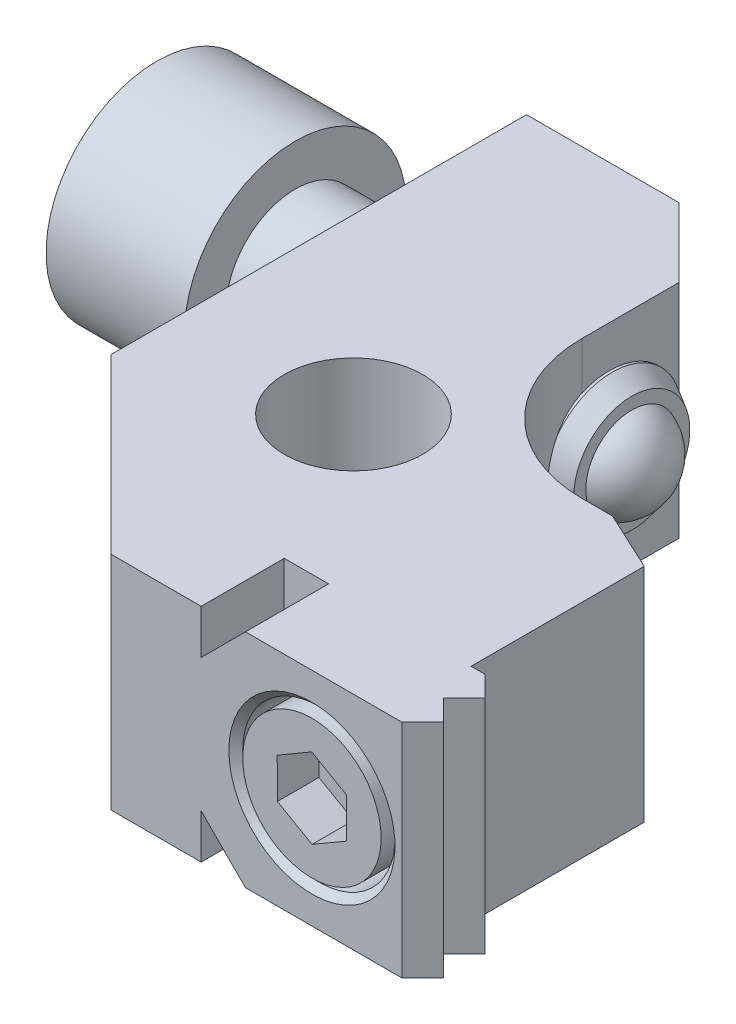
ISO-10303-21;
HEADER;
FILE_DESCRIPTION(('STEP AP214'),'2;1');
FILE_NAME('part.step','',(''),(''),'','','');
FILE_SCHEMA(('AUTOMOTIVE_DESIGN { 1 0 10303 214 1 1 1 1 }'));
ENDSEC;
DATA;
#1=APPLICATION_CONTEXT('core data for automotive mechanical design processes');
#2=APPLICATION_PROTOCOL_DEFINITION('international standard','automotive_design',2000,#1);
#3=PRODUCT_CONTEXT('',#1,'mechanical');
#4=PRODUCT('Part','Part','',(#3));
#5=PRODUCT_RELATED_PRODUCT_CATEGORY('part','',(#4));
#6=PRODUCT_DEFINITION_FORMATION('','',#4);
#7=PRODUCT_DEFINITION_CONTEXT('part definition',#1,'design');
#8=PRODUCT_DEFINITION('design','',#6,#7);
#9=PRODUCT_DEFINITION_SHAPE('','',#8);
#10=(LENGTH_UNIT() NAMED_UNIT(*) SI_UNIT(.MILLI.,.METRE.));
#11=(NAMED_UNIT(*) PLANE_ANGLE_UNIT() SI_UNIT($,.RADIAN.));
#12=(NAMED_UNIT(*) SI_UNIT($,.STERADIAN.) SOLID_ANGLE_UNIT());
#13=UNCERTAINTY_MEASURE_WITH_UNIT(LENGTH_MEASURE(1.E-05),#10,'distance_accuracy_value','');
#14=(GEOMETRIC_REPRESENTATION_CONTEXT(3) GLOBAL_UNCERTAINTY_ASSIGNED_CONTEXT((#13)) GLOBAL_UNIT_ASSIGNED_CONTEXT((#10,
#11,#12)) REPRESENTATION_CONTEXT('',''));
#15=CARTESIAN_POINT('',(0.,0.,0.));
#16=DIRECTION('',(0.,0.,1.));
#17=DIRECTION('',(1.,0.,0.));
#18=AXIS2_PLACEMENT_3D('',#15,#16,#17);
#19=CARTESIAN_POINT('',(14.5,0.,11.5));
#20=DIRECTION('',(0.,0.,1.));
#21=DIRECTION('',(1.,0.,0.));
#22=AXIS2_PLACEMENT_3D('',#19,#20,#21);
#23=CYLINDRICAL_SURFACE('',#22,3.);
#24=CARTESIAN_POINT('',(14.5,0.,3.50000000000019));
#25=DIRECTION('',(0.,0.,-1.));
#26=DIRECTION('',(-0.999990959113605,-0.00425225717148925,0.));
#27=AXIS2_PLACEMENT_3D('',#24,#25,#26);
#28=CIRCLE('',#27,3.);
#29=CARTESIAN_POINT('',(11.5000271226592,-0.0127567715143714,3.50000000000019));
#30=VERTEX_POINT('',#29);
#31=EDGE_CURVE('E287',#30,#30,#28,.T.);
#32=ORIENTED_EDGE('',*,*,#31,.F.);
#33=EDGE_LOOP('',(#32));
#34=FACE_BOUND('',#33,.T.);
#35=CARTESIAN_POINT('',(14.5,0.,-0.5));
#36=DIRECTION('',(0.,0.,1.));
#37=DIRECTION('',(1.,0.,0.));
#38=AXIS2_PLACEMENT_3D('',#35,#36,#37);
#39=CIRCLE('',#38,3.);
#40=CARTESIAN_POINT('',(17.5,0.,-0.5));
#41=VERTEX_POINT('',#40);
#42=EDGE_CURVE('E710',#41,#41,#39,.T.);
#43=ORIENTED_EDGE('',*,*,#42,.F.);
#44=EDGE_LOOP('',(#43));
#45=FACE_BOUND('',#44,.T.);
#46=ADVANCED_FACE('F15',(#34,#45),#23,.F.);
#47=CARTESIAN_POINT('',(14.5,2.5,-0.5));
#48=DIRECTION('',(0.,0.,-1.));
#49=DIRECTION('',(-1.,0.,0.));
#50=AXIS2_PLACEMENT_3D('',#47,#48,#49);
#51=PLANE('',#50);
#52=CARTESIAN_POINT('',(14.5,0.,-0.5));
#53=DIRECTION('',(0.,0.,1.));
#54=DIRECTION('',(1.,0.,0.));
#55=AXIS2_PLACEMENT_3D('',#52,#53,#54);
#56=CIRCLE('',#55,2.5);
#57=CARTESIAN_POINT('',(17.,0.,-0.5));
#58=VERTEX_POINT('',#57);
#59=EDGE_CURVE('E707',#58,#58,#56,.T.);
#60=ORIENTED_EDGE('',*,*,#59,.F.);
#61=EDGE_LOOP('',(#60));
#62=FACE_BOUND('',#61,.T.);
#63=ORIENTED_EDGE('',*,*,#42,.T.);
#64=EDGE_LOOP('',(#63));
#65=FACE_BOUND('',#64,.T.);
#66=ADVANCED_FACE('F404',(#62,#65),#51,.F.);
#67=CARTESIAN_POINT('',(14.5,0.,11.5));
#68=DIRECTION('',(0.,0.,1.));
#69=DIRECTION('',(1.,0.,0.));
#70=AXIS2_PLACEMENT_3D('',#67,#68,#69);
#71=CYLINDRICAL_SURFACE('',#70,2.5);
#72=ORIENTED_EDGE('',*,*,#59,.T.);
#73=EDGE_LOOP('',(#72));
#74=FACE_BOUND('',#73,.T.);
#75=CARTESIAN_POINT('',(14.5,0.,-3.));
#76=DIRECTION('',(0.,0.,1.));
#77=DIRECTION('',(1.,0.,0.));
#78=AXIS2_PLACEMENT_3D('',#75,#76,#77);
#79=CIRCLE('',#78,2.5);
#80=CARTESIAN_POINT('',(15.7109861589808,2.18712425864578,-3.));
#81=VERTEX_POINT('',#80);
#82=CARTESIAN_POINT('',(13.5,2.29128784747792,-3.));
#83=VERTEX_POINT('',#82);
#84=EDGE_CURVE('E716',#81,#83,#79,.T.);
#85=ORIENTED_EDGE('',*,*,#84,.F.);
#86=CARTESIAN_POINT('',(14.5,0.,-3.56469211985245));
#87=DIRECTION('',(-0.422618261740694,0.,0.906307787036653));
#88=DIRECTION('',(0.906307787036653,0.,0.422618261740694));
#89=AXIS2_PLACEMENT_3D('',#86,#87,#88);
#90=ELLIPSE('',#89,2.75844479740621,2.5);
#91=CARTESIAN_POINT('',(15.7109861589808,-2.18712425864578,-3.));
#92=VERTEX_POINT('',#91);
#93=EDGE_CURVE('E269',#92,#81,#90,.T.);
#94=ORIENTED_EDGE('',*,*,#93,.F.);
#95=CARTESIAN_POINT('',(13.5,-2.29128784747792,-3.));
#96=VERTEX_POINT('',#95);
#97=EDGE_CURVE('E713',#96,#92,#79,.T.);
#98=ORIENTED_EDGE('',*,*,#97,.F.);
#99=CARTESIAN_POINT('',(13.5,2.29128784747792,-3.));
#100=CARTESIAN_POINT('',(13.4358871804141,2.26331473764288,-2.99999571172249));
#101=CARTESIAN_POINT('',(13.3729603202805,2.23264009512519,-3.00061652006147));
#102=CARTESIAN_POINT('',(13.2499204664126,2.16614431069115,-3.00293926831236));
#103=CARTESIAN_POINT('',(13.189807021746,2.13032399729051,-3.00464103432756));
#104=CARTESIAN_POINT('',(13.0728846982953,2.0538298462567,-3.008954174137));
#105=CARTESIAN_POINT('',(13.0160719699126,2.01316183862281,-3.01156446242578));
#106=CARTESIAN_POINT('',(12.9060808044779,1.92725139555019,-3.01750052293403));
#107=CARTESIAN_POINT('',(12.8529024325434,1.88200887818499,-3.02082630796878));
#108=CARTESIAN_POINT('',(12.6993783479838,1.73987559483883,-3.0315743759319));
#109=CARTESIAN_POINT('',(12.6049390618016,1.63651049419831,-3.03977188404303));
#110=CARTESIAN_POINT('',(12.4346576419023,1.41557170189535,-3.05653954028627));
#111=CARTESIAN_POINT('',(12.3588158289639,1.29799776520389,-3.06510969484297));
#112=CARTESIAN_POINT('',(12.2271278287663,1.0506418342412,-3.08111654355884));
#113=CARTESIAN_POINT('',(12.1714716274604,0.920757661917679,-3.08854210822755));
#114=CARTESIAN_POINT('',(12.0827779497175,0.653362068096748,-3.10083310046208));
#115=CARTESIAN_POINT('',(12.0497408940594,0.51585050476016,-3.10569848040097));
#116=CARTESIAN_POINT('',(12.0074155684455,0.238005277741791,-3.11199447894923));
#117=CARTESIAN_POINT('',(11.9979824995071,0.0976941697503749,-3.11344603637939));
#118=CARTESIAN_POINT('',(12.0027369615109,-0.182512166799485,-3.11272488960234));
#119=CARTESIAN_POINT('',(12.0169233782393,-0.322407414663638,-3.11055235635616));
#120=CARTESIAN_POINT('',(12.0682820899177,-0.596720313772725,-3.10298830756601));
#121=CARTESIAN_POINT('',(12.1052805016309,-0.731171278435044,-3.09762115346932));
#122=CARTESIAN_POINT('',(12.2010240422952,-0.991972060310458,-3.08460892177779));
#123=CARTESIAN_POINT('',(12.2597699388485,-1.11832159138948,-3.07696376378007));
#124=CARTESIAN_POINT('',(12.3979253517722,-1.36046663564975,-3.06066959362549));
#125=CARTESIAN_POINT('',(12.4774988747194,-1.47616806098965,-3.05201293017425));
#126=CARTESIAN_POINT('',(12.654877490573,-1.69266254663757,-3.03537845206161));
#127=CARTESIAN_POINT('',(12.7526802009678,-1.79345755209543,-3.02740054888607));
#128=CARTESIAN_POINT('',(12.954023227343,-1.96877190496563,-3.01445607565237));
#129=CARTESIAN_POINT('',(13.0561770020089,-2.04486531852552,-3.00927800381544));
#130=CARTESIAN_POINT('',(13.2171736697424,-2.14671963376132,-3.00385541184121));
#131=CARTESIAN_POINT('',(13.272164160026,-2.17863682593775,-3.0024385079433));
#132=CARTESIAN_POINT('',(13.3844379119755,-2.23820437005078,-3.00050976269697));
#133=CARTESIAN_POINT('',(13.4417216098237,-2.26585390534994,-2.99999809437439));
#134=CARTESIAN_POINT('',(13.5,-2.29128784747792,-3.));
#135=B_SPLINE_CURVE_WITH_KNOTS('',3,(#99,#100,#101,#102,#103,#104,#105,#106,#107,#108,#109,#110,
#111,#112,#113,#114,#115,#116,#117,#118,#119,#120,#121,#122,#123,#124,#125,#126,#127,#128,#129,
#130,#131,#132,#133,#134),.UNSPECIFIED.,.F.,.F.,(4,2,2,2,2,2,2,2,2,2,2,2,2,2,2,2,2,4),(0.,
0.209773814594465,0.419513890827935,0.629004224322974,0.838498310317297,1.25711565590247,
1.67574022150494,2.09820844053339,2.52068451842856,2.94056248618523,3.36042064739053,
3.77711736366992,4.19382878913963,4.61392584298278,5.03396802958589,5.41482271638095,
5.60544829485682,5.79611030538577),.UNSPECIFIED.);
#136=EDGE_CURVE('E717',#83,#96,#135,.T.);
#137=ORIENTED_EDGE('',*,*,#136,.F.);
#138=EDGE_LOOP('',(#85,#94,#98,#137));
#139=FACE_BOUND('',#138,.T.);
#140=ADVANCED_FACE('F727',(#74,#139),#71,.F.);
#141=CARTESIAN_POINT('',(13.5,8.,-3.));
#142=DIRECTION('',(0.,0.,1.));
#143=DIRECTION('',(1.,0.,0.));
#144=AXIS2_PLACEMENT_3D('',#141,#142,#143);
#145=PLANE('',#144);
#146=DIRECTION('',(0.,1.,0.));
#147=VECTOR('',#146,1.);
#148=CARTESIAN_POINT('',(15.7109861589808,-8.,-3.));
#149=LINE('',#148,#147);
#150=CARTESIAN_POINT('',(15.7109861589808,8.,-3.));
#151=VERTEX_POINT('',#150);
#152=EDGE_CURVE('E895',#81,#151,#149,.T.);
#153=ORIENTED_EDGE('',*,*,#152,.F.);
#154=ORIENTED_EDGE('',*,*,#84,.T.);
#155=DIRECTION('',(0.,-1.,0.));
#156=VECTOR('',#155,1.);
#157=CARTESIAN_POINT('',(13.5,8.,-3.));
#158=LINE('',#157,#156);
#159=CARTESIAN_POINT('',(13.5,8.,-3.));
#160=VERTEX_POINT('',#159);
#161=EDGE_CURVE('E289',#160,#83,#158,.T.);
#162=ORIENTED_EDGE('',*,*,#161,.F.);
#163=DIRECTION('',(-1.,0.,0.));
#164=VECTOR('',#163,1.);
#165=CARTESIAN_POINT('',(13.5,8.,-3.));
#166=LINE('',#165,#164);
#167=EDGE_CURVE('E310',#151,#160,#166,.T.);
#168=ORIENTED_EDGE('',*,*,#167,.F.);
#169=EDGE_LOOP('',(#153,#154,#162,#168));
#170=FACE_BOUND('',#169,.T.);
#171=ADVANCED_FACE('F408',(#170),#145,.F.);
#172=CARTESIAN_POINT('',(20.,-8.,-1.));
#173=DIRECTION('',(-0.422618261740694,0.,0.906307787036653));
#174=DIRECTION('',(0.906307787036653,0.,0.422618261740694));
#175=AXIS2_PLACEMENT_3D('',#172,#173,#174);
#176=PLANE('',#175);
#177=CARTESIAN_POINT('',(15.7109861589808,-8.,-3.));
#178=VERTEX_POINT('',#177);
#179=EDGE_CURVE('E362',#178,#92,#149,.T.);
#180=ORIENTED_EDGE('',*,*,#179,.T.);
#181=ORIENTED_EDGE('',*,*,#93,.T.);
#182=ORIENTED_EDGE('',*,*,#152,.T.);
#183=DIRECTION('',(0.906307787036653,0.,0.422618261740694));
#184=VECTOR('',#183,1.);
#185=CARTESIAN_POINT('',(20.,8.,-1.));
#186=LINE('',#185,#184);
#187=CARTESIAN_POINT('',(20.,8.,-1.));
#188=VERTEX_POINT('',#187);
#189=EDGE_CURVE('E725',#151,#188,#186,.T.);
#190=ORIENTED_EDGE('',*,*,#189,.T.);
#191=DIRECTION('',(0.,1.,0.));
#192=VECTOR('',#191,1.);
#193=CARTESIAN_POINT('',(20.,-8.,-1.));
#194=LINE('',#193,#192);
#195=CARTESIAN_POINT('',(20.,-8.,-1.));
#196=VERTEX_POINT('',#195);
#197=EDGE_CURVE('E361',#196,#188,#194,.T.);
#198=ORIENTED_EDGE('',*,*,#197,.F.);
#199=DIRECTION('',(0.906307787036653,0.,0.422618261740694));
#200=VECTOR('',#199,1.);
#201=CARTESIAN_POINT('',(20.,-8.,-1.));
#202=LINE('',#201,#200);
#203=EDGE_CURVE('E896',#178,#196,#202,.T.);
#204=ORIENTED_EDGE('',*,*,#203,.F.);
#205=EDGE_LOOP('',(#180,#181,#182,#190,#198,#204));
#206=FACE_BOUND('',#205,.T.);
#207=ADVANCED_FACE('F377',(#206),#176,.F.);
#208=CARTESIAN_POINT('',(13.5,-8.,-3.));
#209=VERTEX_POINT('',#208);
#210=EDGE_CURVE('E292',#96,#209,#158,.T.);
#211=ORIENTED_EDGE('',*,*,#210,.F.);
#212=ORIENTED_EDGE('',*,*,#97,.T.);
#213=ORIENTED_EDGE('',*,*,#179,.F.);
#214=DIRECTION('',(-1.,0.,0.));
#215=VECTOR('',#214,1.);
#216=CARTESIAN_POINT('',(13.5,-8.,-3.));
#217=LINE('',#216,#215);
#218=EDGE_CURVE('E334',#178,#209,#217,.T.);
#219=ORIENTED_EDGE('',*,*,#218,.T.);
#220=EDGE_LOOP('',(#211,#212,#213,#219));
#221=FACE_BOUND('',#220,.T.);
#222=ADVANCED_FACE('F410',(#221),#145,.F.);
#223=CARTESIAN_POINT('',(13.5,8.,-13.));
#224=DIRECTION('',(0.,-1.,0.));
#225=DIRECTION('',(1.,0.,0.));
#226=AXIS2_PLACEMENT_3D('',#223,#224,#225);
#227=CYLINDRICAL_SURFACE('',#226,10.);
#228=ORIENTED_EDGE('',*,*,#161,.T.);
#229=ORIENTED_EDGE('',*,*,#136,.T.);
#230=ORIENTED_EDGE('',*,*,#210,.T.);
#231=CARTESIAN_POINT('',(13.5,-8.,-13.));
#232=DIRECTION('',(0.,-1.,0.));
#233=DIRECTION('',(-1.,0.,0.));
#234=AXIS2_PLACEMENT_3D('',#231,#232,#233);
#235=CIRCLE('',#234,10.);
#236=CARTESIAN_POINT('',(3.5,-8.,-13.));
#237=VERTEX_POINT('',#236);
#238=EDGE_CURVE('E331',#209,#237,#235,.T.);
#239=ORIENTED_EDGE('',*,*,#238,.T.);
#240=DIRECTION('',(0.,-1.,0.));
#241=VECTOR('',#240,1.);
#242=CARTESIAN_POINT('',(3.5,8.,-13.));
#243=LINE('',#242,#241);
#244=CARTESIAN_POINT('',(3.5,-4.58257569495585,-13.));
#245=VERTEX_POINT('',#244);
#246=EDGE_CURVE('E295',#245,#237,#243,.T.);
#247=ORIENTED_EDGE('',*,*,#246,.F.);
#248=CARTESIAN_POINT('',(3.7,-3.01332051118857,-11.0100251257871));
#249=CARTESIAN_POINT('',(3.68312897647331,-3.12333897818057,-11.0931019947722));
#250=CARTESIAN_POINT('',(3.66643022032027,-3.22993343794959,-11.180761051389));
#251=CARTESIAN_POINT('',(3.63416950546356,-3.4356725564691,-11.3647304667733));
#252=CARTESIAN_POINT('',(3.61860821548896,-3.5348128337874,-11.4610458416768));
#253=CARTESIAN_POINT('',(3.58975564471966,-3.72283056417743,-11.6595194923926));
#254=CARTESIAN_POINT('',(3.5764221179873,-3.81188520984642,-11.7615036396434));
#255=CARTESIAN_POINT('',(3.55236163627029,-3.98152350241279,-11.9724943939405));
#256=CARTESIAN_POINT('',(3.54163339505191,-4.06211131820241,-12.0814975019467));
#257=CARTESIAN_POINT('',(3.52235267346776,-4.22377485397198,-12.3198982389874));
#258=CARTESIAN_POINT('',(3.51423833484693,-4.30365827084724,-12.4501440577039));
#259=CARTESIAN_POINT('',(3.50301764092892,-4.45219765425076,-12.7192252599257));
#260=CARTESIAN_POINT('',(3.49997529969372,-4.52070042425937,-12.8581478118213));
#261=CARTESIAN_POINT('',(3.5,-4.58257569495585,-13.));
#262=B_SPLINE_CURVE_WITH_KNOTS('',3,(#248,#249,#250,#251,#252,#253,#254,#255,#256,#257,#258,
#259,#260,#261),.UNSPECIFIED.,.F.,.F.,(4,2,2,2,2,2,4),(0.,0.416566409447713,0.833375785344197,
1.24105806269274,1.64853865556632,2.10683201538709,2.57086691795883),.UNSPECIFIED.);
#263=CARTESIAN_POINT('',(3.7,-3.01332051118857,-11.0100251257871));
#264=VERTEX_POINT('',#263);
#265=EDGE_CURVE('E692',#264,#245,#262,.T.);
#266=ORIENTED_EDGE('',*,*,#265,.F.);
#267=CARTESIAN_POINT('',(3.5,-4.58257569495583,-13.));
#268=CARTESIAN_POINT('',(3.49998448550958,-4.5274934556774,-12.8737454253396));
#269=CARTESIAN_POINT('',(3.5023906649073,-4.46717333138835,-12.7498093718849));
#270=CARTESIAN_POINT('',(3.5114038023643,-4.33662648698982,-12.5075005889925));
#271=CARTESIAN_POINT('',(3.51800876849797,-4.26640447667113,-12.3891252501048));
#272=CARTESIAN_POINT('',(3.53475554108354,-4.11677109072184,-12.1590523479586));
#273=CARTESIAN_POINT('',(3.54488779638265,-4.03738491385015,-12.0473376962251));
#274=CARTESIAN_POINT('',(3.5679681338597,-3.86989697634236,-11.8309882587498));
#275=CARTESIAN_POINT('',(3.58091649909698,-3.78179434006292,-11.7263541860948));
#276=CARTESIAN_POINT('',(3.62282812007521,-3.50556138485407,-11.4243514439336));
#277=CARTESIAN_POINT('',(3.6549008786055,-3.30517448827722,-11.238374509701));
#278=CARTESIAN_POINT('',(3.72113048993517,-2.87704843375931,-10.9015924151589));
#279=CARTESIAN_POINT('',(3.75528872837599,-2.64929099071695,-10.7508109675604));
#280=CARTESIAN_POINT('',(3.8208642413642,-2.16302343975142,-10.4832479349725));
#281=CARTESIAN_POINT('',(3.85213542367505,-1.90369283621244,-10.367912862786));
#282=CARTESIAN_POINT('',(3.90461382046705,-1.36838848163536,-10.1825641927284));
#283=CARTESIAN_POINT('',(3.92582463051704,-1.09242071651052,-10.1125343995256));
#284=CARTESIAN_POINT('',(3.95382739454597,-0.537963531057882,-10.0212664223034));
#285=CARTESIAN_POINT('',(3.96092282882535,-0.259659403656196,-9.99900047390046));
#286=CARTESIAN_POINT('',(3.96027153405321,0.296730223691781,-10.0010682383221));
#287=CARTESIAN_POINT('',(3.95252700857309,0.574815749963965,-10.0253950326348));
#288=CARTESIAN_POINT('',(3.92415424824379,1.11317948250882,-10.1180967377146));
#289=CARTESIAN_POINT('',(3.90396515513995,1.37374222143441,-10.1849726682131));
#290=CARTESIAN_POINT('',(3.85456900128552,1.88009136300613,-10.3592054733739));
#291=CARTESIAN_POINT('',(3.82535914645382,2.12587315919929,-10.4665748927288));
#292=CARTESIAN_POINT('',(3.76181285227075,2.60413120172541,-10.722798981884));
#293=CARTESIAN_POINT('',(3.72734414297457,2.83594649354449,-10.8728514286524));
#294=CARTESIAN_POINT('',(3.66016372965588,3.27195255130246,-11.2092214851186));
#295=CARTESIAN_POINT('',(3.62745142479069,3.47615280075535,-11.3955265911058));
#296=CARTESIAN_POINT('',(3.58432882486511,3.75886912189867,-11.6999239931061));
#297=CARTESIAN_POINT('',(3.5708732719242,3.8497248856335,-11.8063762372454));
#298=CARTESIAN_POINT('',(3.54685717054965,4.0223538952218,-12.0267464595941));
#299=CARTESIAN_POINT('',(3.53629635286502,4.10412798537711,-12.1406637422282));
#300=CARTESIAN_POINT('',(3.51882560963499,4.25812537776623,-12.3754764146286));
#301=CARTESIAN_POINT('',(3.51192530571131,4.33032313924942,-12.496389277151));
#302=CARTESIAN_POINT('',(3.50250296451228,4.46437088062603,-12.7440564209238));
#303=CARTESIAN_POINT('',(3.49998308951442,4.52621573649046,-12.8708135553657));
#304=CARTESIAN_POINT('',(3.5,4.58257569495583,-13.));
#305=B_SPLINE_CURVE_WITH_KNOTS('',3,(#267,#268,#269,#270,#271,#272,#273,#274,#275,#276,#277,
#278,#279,#280,#281,#282,#283,#284,#285,#286,#287,#288,#289,#290,#291,#292,#293,#294,#295,#296,
#297,#298,#299,#300,#301,#302,#303,#304),.UNSPECIFIED.,.F.,.F.,(4,2,2,2,2,2,2,2,2,2,2,2,2,2,2,2,
2,2,4),(0.,0.41305614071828,0.825916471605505,1.2376674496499,1.64945983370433,2.47124333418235,
3.29357891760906,4.14601448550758,4.99814516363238,5.831748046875,6.66522715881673,
7.4708564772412,8.27673558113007,9.10794253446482,9.93886330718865,10.3602286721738,
10.7815548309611,11.2039830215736,11.6266196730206),.UNSPECIFIED.);
#306=CARTESIAN_POINT('',(3.7,3.01332051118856,-11.0100251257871));
#307=VERTEX_POINT('',#306);
#308=EDGE_CURVE('E352',#264,#307,#305,.T.);
#309=ORIENTED_EDGE('',*,*,#308,.T.);
#310=CARTESIAN_POINT('',(3.5,4.58257569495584,-13.));
#311=CARTESIAN_POINT('',(3.49998356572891,4.52704052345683,-12.8727026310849));
#312=CARTESIAN_POINT('',(3.50243018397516,4.46617625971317,-12.7477594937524));
#313=CARTESIAN_POINT('',(3.51159013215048,4.3343600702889,-12.5034974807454));
#314=CARTESIAN_POINT('',(3.51830278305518,4.26340975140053,-12.3841777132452));
#315=CARTESIAN_POINT('',(3.53515428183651,4.11358792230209,-12.1545112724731));
#316=CARTESIAN_POINT('',(3.545217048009,4.03491749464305,-12.0440275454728));
#317=CARTESIAN_POINT('',(3.56809581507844,3.86905011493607,-11.8300197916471));
#318=CARTESIAN_POINT('',(3.5809110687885,3.7818554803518,-11.7264938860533));
#319=CARTESIAN_POINT('',(3.61031150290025,3.58802825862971,-11.5144306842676));
#320=CARTESIAN_POINT('',(3.62716817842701,3.48033050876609,-11.4069031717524));
#321=CARTESIAN_POINT('',(3.66259945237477,3.25435516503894,-11.2009379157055));
#322=CARTESIAN_POINT('',(3.68119261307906,3.13596384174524,-11.1026280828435));
#323=CARTESIAN_POINT('',(3.7,3.01332051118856,-11.0100251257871));
#324=B_SPLINE_CURVE_WITH_KNOTS('',3,(#310,#311,#312,#313,#314,#315,#316,#317,#318,#319,#320,
#321,#322,#323),.UNSPECIFIED.,.F.,.F.,(4,2,2,2,2,2,4),(0.,0.416471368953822,0.832876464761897,
1.24040559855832,1.64782424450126,2.10653202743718,2.57087560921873),.UNSPECIFIED.);
#325=CARTESIAN_POINT('',(3.5,4.58257569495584,-13.));
#326=VERTEX_POINT('',#325);
#327=EDGE_CURVE('E684',#326,#307,#324,.T.);
#328=ORIENTED_EDGE('',*,*,#327,.F.);
#329=CARTESIAN_POINT('',(3.5,8.,-13.));
#330=VERTEX_POINT('',#329);
#331=EDGE_CURVE('E293',#330,#326,#243,.T.);
#332=ORIENTED_EDGE('',*,*,#331,.F.);
#333=CARTESIAN_POINT('',(13.5,8.,-13.));
#334=DIRECTION('',(0.,-1.,0.));
#335=DIRECTION('',(-1.,0.,0.));
#336=AXIS2_PLACEMENT_3D('',#333,#334,#335);
#337=CIRCLE('',#336,10.);
#338=EDGE_CURVE('E254',#160,#330,#337,.T.);
#339=ORIENTED_EDGE('',*,*,#338,.F.);
#340=EDGE_LOOP('',(#228,#229,#230,#239,#247,#266,#309,#328,#332,#339));
#341=FACE_BOUND('',#340,.T.);
#342=ADVANCED_FACE('F364',(#341),#227,.F.);
#343=CARTESIAN_POINT('',(20.,8.,-3.));
#344=DIRECTION('',(-1.,0.,0.));
#345=DIRECTION('',(0.,-1.,0.));
#346=AXIS2_PLACEMENT_3D('',#343,#344,#345);
#347=PLANE('',#346);
#348=DIRECTION('',(0.,0.,-1.));
#349=VECTOR('',#348,1.);
#350=CARTESIAN_POINT('',(20.,-8.,-3.));
#351=LINE('',#350,#349);
#352=CARTESIAN_POINT('',(20.,-8.,11.5));
#353=VERTEX_POINT('',#352);
#354=EDGE_CURVE('E337',#353,#196,#351,.T.);
#355=ORIENTED_EDGE('',*,*,#354,.T.);
#356=ORIENTED_EDGE('',*,*,#197,.T.);
#357=DIRECTION('',(0.,0.,-1.));
#358=VECTOR('',#357,1.);
#359=CARTESIAN_POINT('',(20.,8.,-3.));
#360=LINE('',#359,#358);
#361=CARTESIAN_POINT('',(20.,8.,11.5000000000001));
#362=VERTEX_POINT('',#361);
#363=EDGE_CURVE('E312',#362,#188,#360,.T.);
#364=ORIENTED_EDGE('',*,*,#363,.F.);
#365=DIRECTION('',(0.,-1.,0.));
#366=VECTOR('',#365,1.);
#367=CARTESIAN_POINT('',(20.,8.,11.5));
#368=LINE('',#367,#366);
#369=EDGE_CURVE('E285',#362,#353,#368,.T.);
#370=ORIENTED_EDGE('',*,*,#369,.T.);
#371=EDGE_LOOP('',(#355,#356,#364,#370));
#372=FACE_BOUND('',#371,.T.);
#373=ADVANCED_FACE('F407',(#372),#347,.F.);
#374=CARTESIAN_POINT('',(3.5,8.,-25.));
#375=DIRECTION('',(-1.,0.,0.));
#376=DIRECTION('',(0.,0.,1.));
#377=AXIS2_PLACEMENT_3D('',#374,#375,#376);
#378=PLANE('',#377);
#379=DIRECTION('',(0.,0.,-1.));
#380=VECTOR('',#379,1.);
#381=CARTESIAN_POINT('',(3.5,-8.,-25.));
#382=LINE('',#381,#380);
#383=CARTESIAN_POINT('',(3.5,-8.,-20.));
#384=VERTEX_POINT('',#383);
#385=EDGE_CURVE('E329',#237,#384,#382,.T.);
#386=ORIENTED_EDGE('',*,*,#385,.T.);
#387=DIRECTION('',(0.,1.,0.));
#388=VECTOR('',#387,1.);
#389=CARTESIAN_POINT('',(3.5,8.,-20.));
#390=LINE('',#389,#388);
#391=CARTESIAN_POINT('',(3.5,0.,-20.));
#392=VERTEX_POINT('',#391);
#393=EDGE_CURVE('E246',#384,#392,#390,.T.);
#394=ORIENTED_EDGE('',*,*,#393,.T.);
#395=CARTESIAN_POINT('',(3.5,0.,-15.));
#396=DIRECTION('',(-1.,0.,0.));
#397=DIRECTION('',(0.,0.,-1.));
#398=AXIS2_PLACEMENT_3D('',#395,#396,#397);
#399=CIRCLE('',#398,5.);
#400=EDGE_CURVE('E700',#245,#392,#399,.F.);
#401=ORIENTED_EDGE('',*,*,#400,.F.);
#402=ORIENTED_EDGE('',*,*,#246,.T.);
#403=EDGE_LOOP('',(#386,#394,#401,#402));
#404=FACE_BOUND('',#403,.T.);
#405=ADVANCED_FACE('F376',(#404),#378,.F.);
#406=CARTESIAN_POINT('',(20.8,0.,-15.));
#407=DIRECTION('',(1.,0.,0.));
#408=DIRECTION('',(0.,-0.972482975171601,-0.232973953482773));
#409=AXIS2_PLACEMENT_3D('',#406,#407,#408);
#410=CYLINDRICAL_SURFACE('',#409,5.);
#411=CARTESIAN_POINT('',(3.7,0.,-15.));
#412=DIRECTION('',(1.,0.,0.));
#413=DIRECTION('',(0.,-0.972482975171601,-0.232973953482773));
#414=AXIS2_PLACEMENT_3D('',#411,#412,#413);
#415=CIRCLE('',#414,5.);
#416=EDGE_CURVE('E913',#307,#264,#415,.F.);
#417=ORIENTED_EDGE('',*,*,#416,.T.);
#418=ORIENTED_EDGE('',*,*,#265,.T.);
#419=ORIENTED_EDGE('',*,*,#400,.T.);
#420=CARTESIAN_POINT('',(3.5,0.,-15.));
#421=DIRECTION('',(-1.,0.,0.));
#422=DIRECTION('',(0.,0.,-1.));
#423=AXIS2_PLACEMENT_3D('',#420,#421,#422);
#424=CIRCLE('',#423,5.);
#425=EDGE_CURVE('E241',#392,#326,#424,.F.);
#426=ORIENTED_EDGE('',*,*,#425,.T.);
#427=ORIENTED_EDGE('',*,*,#327,.T.);
#428=EDGE_LOOP('',(#417,#418,#419,#426,#427));
#429=FACE_BOUND('',#428,.T.);
#430=ADVANCED_FACE('F373',(#429),#410,.T.);
#431=CARTESIAN_POINT('',(-12.5,0.,-15.));
#432=DIRECTION('',(-1.,0.,0.));
#433=DIRECTION('',(0.,0.,1.));
#434=AXIS2_PLACEMENT_3D('',#431,#432,#433);
#435=CYLINDRICAL_SURFACE('',#434,5.);
#436=ORIENTED_EDGE('',*,*,#308,.F.);
#437=EDGE_CURVE('E641',#264,#307,#415,.F.);
#438=ORIENTED_EDGE('',*,*,#437,.T.);
#439=EDGE_LOOP('',(#436,#438));
#440=FACE_BOUND('',#439,.T.);
#441=ADVANCED_FACE('F368',(#440),#435,.F.);
#442=ORIENTED_EDGE('',*,*,#425,.F.);
#443=DIRECTION('',(0.,1.,0.));
#444=VECTOR('',#443,1.);
#445=CARTESIAN_POINT('',(3.5,8.,-20.));
#446=LINE('',#445,#444);
#447=CARTESIAN_POINT('',(3.5,8.,-20.));
#448=VERTEX_POINT('',#447);
#449=EDGE_CURVE('E236',#392,#448,#446,.T.);
#450=ORIENTED_EDGE('',*,*,#449,.T.);
#451=DIRECTION('',(0.,0.,-1.));
#452=VECTOR('',#451,1.);
#453=CARTESIAN_POINT('',(3.5,8.,-25.));
#454=LINE('',#453,#452);
#455=EDGE_CURVE('E240',#330,#448,#454,.T.);
#456=ORIENTED_EDGE('',*,*,#455,.F.);
#457=ORIENTED_EDGE('',*,*,#331,.T.);
#458=EDGE_LOOP('',(#442,#450,#456,#457));
#459=FACE_BOUND('',#458,.T.);
#460=ADVANCED_FACE('F238',(#459),#378,.F.);
#461=CARTESIAN_POINT('',(-1.5,8.,-25.));
#462=DIRECTION('',(-0.707106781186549,0.,0.707106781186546));
#463=DIRECTION('',(0.707106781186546,0.,0.707106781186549));
#464=AXIS2_PLACEMENT_3D('',#461,#462,#463);
#465=PLANE('',#464);
#466=ORIENTED_EDGE('',*,*,#449,.F.);
#467=ORIENTED_EDGE('',*,*,#393,.F.);
#468=DIRECTION('',(-0.707106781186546,0.,-0.707106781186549));
#469=VECTOR('',#468,1.);
#470=CARTESIAN_POINT('',(-1.5,-8.,-25.));
#471=LINE('',#470,#469);
#472=CARTESIAN_POINT('',(-1.5,-8.,-25.));
#473=VERTEX_POINT('',#472);
#474=EDGE_CURVE('E229',#473,#384,#471,.F.);
#475=ORIENTED_EDGE('',*,*,#474,.F.);
#476=DIRECTION('',(0.,-1.,0.));
#477=VECTOR('',#476,1.);
#478=CARTESIAN_POINT('',(-1.5,8.,-25.));
#479=LINE('',#478,#477);
#480=CARTESIAN_POINT('',(-1.5,8.,-25.));
#481=VERTEX_POINT('',#480);
#482=EDGE_CURVE('E261',#481,#473,#479,.T.);
#483=ORIENTED_EDGE('',*,*,#482,.F.);
#484=DIRECTION('',(0.707106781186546,0.,0.707106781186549));
#485=VECTOR('',#484,1.);
#486=CARTESIAN_POINT('',(12.,8.,-11.5));
#487=LINE('',#486,#485);
#488=EDGE_CURVE('E19',#448,#481,#487,.F.);
#489=ORIENTED_EDGE('',*,*,#488,.F.);
#490=EDGE_LOOP('',(#466,#467,#475,#483,#489));
#491=FACE_BOUND('',#490,.T.);
#492=ADVANCED_FACE('F259',(#491),#465,.F.);
#493=CARTESIAN_POINT('',(-12.5,8.,-25.));
#494=DIRECTION('',(0.,0.,1.));
#495=DIRECTION('',(1.,0.,0.));
#496=AXIS2_PLACEMENT_3D('',#493,#494,#495);
#497=PLANE('',#496);
#498=DIRECTION('',(-1.,0.,0.));
#499=VECTOR('',#498,1.);
#500=CARTESIAN_POINT('',(-12.5,8.,-25.));
#501=LINE('',#500,#499);
#502=CARTESIAN_POINT('',(-12.5,8.,-25.));
#503=VERTEX_POINT('',#502);
#504=EDGE_CURVE('E256',#481,#503,#501,.T.);
#505=ORIENTED_EDGE('',*,*,#504,.F.);
#506=ORIENTED_EDGE('',*,*,#482,.T.);
#507=DIRECTION('',(-1.,0.,0.));
#508=VECTOR('',#507,1.);
#509=CARTESIAN_POINT('',(-12.5,-8.,-25.));
#510=LINE('',#509,#508);
#511=CARTESIAN_POINT('',(-12.5,-8.,-25.));
#512=VERTEX_POINT('',#511);
#513=EDGE_CURVE('E327',#473,#512,#510,.T.);
#514=ORIENTED_EDGE('',*,*,#513,.T.);
#515=DIRECTION('',(0.,-1.,0.));
#516=VECTOR('',#515,1.);
#517=CARTESIAN_POINT('',(-12.5,8.,-25.));
#518=LINE('',#517,#516);
#519=EDGE_CURVE('E296',#503,#512,#518,.T.);
#520=ORIENTED_EDGE('',*,*,#519,.F.);
#521=EDGE_LOOP('',(#505,#506,#514,#520));
#522=FACE_BOUND('',#521,.T.);
#523=ADVANCED_FACE('F393',(#522),#497,.F.);
#524=CARTESIAN_POINT('',(-12.5,8.,17.5));
#525=DIRECTION('',(1.,0.,0.));
#526=DIRECTION('',(0.,0.,-1.));
#527=AXIS2_PLACEMENT_3D('',#524,#525,#526);
#528=PLANE('',#527);
#529=CARTESIAN_POINT('',(-12.5,0.,-15.));
#530=DIRECTION('',(-1.,0.,0.));
#531=DIRECTION('',(0.,0.,1.));
#532=AXIS2_PLACEMENT_3D('',#529,#530,#531);
#533=CIRCLE('',#532,5.5);
#534=CARTESIAN_POINT('',(-12.5,0.,-9.5));
#535=VERTEX_POINT('',#534);
#536=EDGE_CURVE('E701',#535,#535,#533,.T.);
#537=ORIENTED_EDGE('',*,*,#536,.F.);
#538=EDGE_LOOP('',(#537));
#539=FACE_BOUND('',#538,.T.);
#540=DIRECTION('',(0.,0.,1.));
#541=VECTOR('',#540,1.);
#542=CARTESIAN_POINT('',(-12.5,-8.,17.5));
#543=LINE('',#542,#541);
#544=CARTESIAN_POINT('',(-12.5,-8.,5.));
#545=VERTEX_POINT('',#544);
#546=EDGE_CURVE('E324',#512,#545,#543,.T.);
#547=ORIENTED_EDGE('',*,*,#546,.T.);
#548=DIRECTION('',(0.,1.,0.));
#549=VECTOR('',#548,1.);
#550=CARTESIAN_POINT('',(-12.5,8.,5.));
#551=LINE('',#550,#549);
#552=CARTESIAN_POINT('',(-12.5,8.,5.));
#553=VERTEX_POINT('',#552);
#554=EDGE_CURVE('E274',#545,#553,#551,.T.);
#555=ORIENTED_EDGE('',*,*,#554,.T.);
#556=DIRECTION('',(0.,0.,1.));
#557=VECTOR('',#556,1.);
#558=CARTESIAN_POINT('',(-12.5,8.,17.5));
#559=LINE('',#558,#557);
#560=EDGE_CURVE('E305',#503,#553,#559,.T.);
#561=ORIENTED_EDGE('',*,*,#560,.F.);
#562=ORIENTED_EDGE('',*,*,#519,.T.);
#563=EDGE_LOOP('',(#547,#555,#561,#562));
#564=FACE_BOUND('',#563,.T.);
#565=ADVANCED_FACE('F383',(#539,#564),#528,.F.);
#566=CARTESIAN_POINT('',(0.,8.,17.5));
#567=DIRECTION('',(0.707106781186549,0.,-0.707106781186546));
#568=DIRECTION('',(-0.707106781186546,0.,-0.707106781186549));
#569=AXIS2_PLACEMENT_3D('',#566,#567,#568);
#570=PLANE('',#569);
#571=DIRECTION('',(-0.707106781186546,0.,-0.707106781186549));
#572=VECTOR('',#571,1.);
#573=CARTESIAN_POINT('',(-8.5,8.,9.));
#574=LINE('',#573,#572);
#575=CARTESIAN_POINT('',(0.,8.,17.5));
#576=VERTEX_POINT('',#575);
#577=EDGE_CURVE('E272',#553,#576,#574,.F.);
#578=ORIENTED_EDGE('',*,*,#577,.F.);
#579=ORIENTED_EDGE('',*,*,#554,.F.);
#580=DIRECTION('',(0.707106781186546,0.,0.707106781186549));
#581=VECTOR('',#580,1.);
#582=CARTESIAN_POINT('',(0.,-8.,17.5));
#583=LINE('',#582,#581);
#584=CARTESIAN_POINT('',(0.,-8.,17.5));
#585=VERTEX_POINT('',#584);
#586=EDGE_CURVE('E276',#585,#545,#583,.F.);
#587=ORIENTED_EDGE('',*,*,#586,.F.);
#588=DIRECTION('',(0.,-1.,0.));
#589=VECTOR('',#588,1.);
#590=CARTESIAN_POINT('',(0.,8.,17.5));
#591=LINE('',#590,#589);
#592=EDGE_CURVE('E278',#576,#585,#591,.T.);
#593=ORIENTED_EDGE('',*,*,#592,.F.);
#594=EDGE_LOOP('',(#578,#579,#587,#593));
#595=FACE_BOUND('',#594,.T.);
#596=ADVANCED_FACE('F379',(#595),#570,.F.);
#597=CARTESIAN_POINT('',(9.,0.,13.5000000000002));
#598=DIRECTION('',(0.,0.,-1.));
#599=DIRECTION('',(1.,0.,0.));
#600=AXIS2_PLACEMENT_3D('',#597,#598,#599);
#601=PLANE('',#600);
#602=CARTESIAN_POINT('',(14.5,0.,13.5));
#603=DIRECTION('',(0.,0.,1.));
#604=DIRECTION('',(-1.,0.,0.));
#605=AXIS2_PLACEMENT_3D('',#602,#603,#604);
#606=CIRCLE('',#605,5.5);
#607=CARTESIAN_POINT('',(9.,0.,13.5));
#608=VERTEX_POINT('',#607);
#609=EDGE_CURVE('E811',#608,#608,#606,.T.);
#610=ORIENTED_EDGE('',*,*,#609,.T.);
#611=EDGE_LOOP('',(#610));
#612=FACE_BOUND('',#611,.T.);
#613=CARTESIAN_POINT('',(14.5,0.,13.5000000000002));
#614=DIRECTION('',(0.,0.,-1.));
#615=DIRECTION('',(-0.999990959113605,-0.00425225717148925,0.));
#616=AXIS2_PLACEMENT_3D('',#613,#614,#615);
#617=CIRCLE('',#616,5.);
#618=CARTESIAN_POINT('',(9.50004520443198,-0.0212612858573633,13.5000000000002));
#619=VERTEX_POINT('',#618);
#620=EDGE_CURVE('E746',#619,#619,#617,.T.);
#621=ORIENTED_EDGE('',*,*,#620,.T.);
#622=EDGE_LOOP('',(#621));
#623=FACE_BOUND('',#622,.T.);
#624=ADVANCED_FACE('F382',(#612,#623),#601,.F.);
#625=CARTESIAN_POINT('',(14.5,0.,17.5));
#626=DIRECTION('',(0.,0.,1.));
#627=DIRECTION('',(-1.,0.,0.));
#628=AXIS2_PLACEMENT_3D('',#625,#626,#627);
#629=CYLINDRICAL_SURFACE('',#628,5.5);
#630=ORIENTED_EDGE('',*,*,#609,.F.);
#631=EDGE_LOOP('',(#630));
#632=FACE_BOUND('',#631,.T.);
#633=CARTESIAN_POINT('',(14.5,0.,16.9999998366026));
#634=DIRECTION('',(0.,0.,1.));
#635=DIRECTION('',(-1.,0.,0.));
#636=AXIS2_PLACEMENT_3D('',#633,#634,#635);
#637=CIRCLE('',#636,5.5);
#638=CARTESIAN_POINT('',(9.,0.,16.9999998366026));
#639=VERTEX_POINT('',#638);
#640=EDGE_CURVE('E814',#639,#639,#637,.T.);
#641=ORIENTED_EDGE('',*,*,#640,.T.);
#642=EDGE_LOOP('',(#641));
#643=FACE_BOUND('',#642,.T.);
#644=ADVANCED_FACE('F466',(#632,#643),#629,.F.);
#645=CARTESIAN_POINT('',(14.5,0.,17.5));
#646=DIRECTION('',(0.,0.,1.));
#647=DIRECTION('',(-1.,0.,0.));
#648=AXIS2_PLACEMENT_3D('',#645,#646,#647);
#649=CONICAL_SURFACE('',#648,6.,0.785398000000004);
#650=ORIENTED_EDGE('',*,*,#640,.F.);
#651=EDGE_LOOP('',(#650));
#652=FACE_BOUND('',#651,.T.);
#653=CARTESIAN_POINT('',(14.5,0.,17.5));
#654=DIRECTION('',(0.,0.,1.));
#655=DIRECTION('',(-1.,0.,0.));
#656=AXIS2_PLACEMENT_3D('',#653,#654,#655);
#657=CIRCLE('',#656,6.);
#658=CARTESIAN_POINT('',(8.5,0.,17.5));
#659=VERTEX_POINT('',#658);
#660=EDGE_CURVE('E817',#659,#659,#657,.T.);
#661=ORIENTED_EDGE('',*,*,#660,.T.);
#662=EDGE_LOOP('',(#661));
#663=FACE_BOUND('',#662,.T.);
#664=ADVANCED_FACE('F441',(#652,#663),#649,.F.);
#665=CARTESIAN_POINT('',(22.5,-8.,17.5));
#666=DIRECTION('',(0.,0.,1.));
#667=DIRECTION('',(-1.,0.,0.));
#668=AXIS2_PLACEMENT_3D('',#665,#666,#667);
#669=PLANE('',#668);
#670=ORIENTED_EDGE('',*,*,#660,.F.);
#671=EDGE_LOOP('',(#670));
#672=FACE_BOUND('',#671,.T.);
#673=DIRECTION('',(0.,1.,0.));
#674=VECTOR('',#673,1.);
#675=CARTESIAN_POINT('',(21.,-8.,17.5));
#676=LINE('',#675,#674);
#677=CARTESIAN_POINT('',(21.,-8.,17.5));
#678=VERTEX_POINT('',#677);
#679=CARTESIAN_POINT('',(21.,8.,17.5));
#680=VERTEX_POINT('',#679);
#681=EDGE_CURVE('E842',#678,#680,#676,.T.);
#682=ORIENTED_EDGE('',*,*,#681,.T.);
#683=DIRECTION('',(-1.,0.,0.));
#684=VECTOR('',#683,1.);
#685=CARTESIAN_POINT('',(22.5,8.,17.5));
#686=LINE('',#685,#684);
#687=CARTESIAN_POINT('',(9.7,8.,17.5));
#688=VERTEX_POINT('',#687);
#689=EDGE_CURVE('E858',#680,#688,#686,.T.);
#690=ORIENTED_EDGE('',*,*,#689,.T.);
#691=DIRECTION('',(-0.707106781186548,-0.707106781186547,0.));
#692=VECTOR('',#691,1.);
#693=CARTESIAN_POINT('',(6.5,4.8,17.5));
#694=LINE('',#693,#692);
#695=CARTESIAN_POINT('',(6.5,4.8,17.5));
#696=VERTEX_POINT('',#695);
#697=EDGE_CURVE('E860',#688,#696,#694,.T.);
#698=ORIENTED_EDGE('',*,*,#697,.T.);
#699=DIRECTION('',(0.,-1.,0.));
#700=VECTOR('',#699,1.);
#701=CARTESIAN_POINT('',(6.5,8.,17.5));
#702=LINE('',#701,#700);
#703=CARTESIAN_POINT('',(6.5,8.,17.5));
#704=VERTEX_POINT('',#703);
#705=EDGE_CURVE('E299',#704,#696,#702,.T.);
#706=ORIENTED_EDGE('',*,*,#705,.F.);
#707=DIRECTION('',(1.,0.,0.));
#708=VECTOR('',#707,1.);
#709=CARTESIAN_POINT('',(6.5,8.,17.5));
#710=LINE('',#709,#708);
#711=EDGE_CURVE('E303',#576,#704,#710,.T.);
#712=ORIENTED_EDGE('',*,*,#711,.F.);
#713=ORIENTED_EDGE('',*,*,#592,.T.);
#714=DIRECTION('',(1.,0.,0.));
#715=VECTOR('',#714,1.);
#716=CARTESIAN_POINT('',(6.5,-8.,17.5));
#717=LINE('',#716,#715);
#718=CARTESIAN_POINT('',(6.5,-8.,17.5));
#719=VERTEX_POINT('',#718);
#720=EDGE_CURVE('E321',#585,#719,#717,.T.);
#721=ORIENTED_EDGE('',*,*,#720,.T.);
#722=CARTESIAN_POINT('',(6.5,-4.8,17.5));
#723=VERTEX_POINT('',#722);
#724=EDGE_CURVE('E302',#723,#719,#702,.T.);
#725=ORIENTED_EDGE('',*,*,#724,.F.);
#726=DIRECTION('',(0.707106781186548,-0.707106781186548,0.));
#727=VECTOR('',#726,1.);
#728=CARTESIAN_POINT('',(9.7,-8.,17.5));
#729=LINE('',#728,#727);
#730=CARTESIAN_POINT('',(9.7,-8.,17.5));
#731=VERTEX_POINT('',#730);
#732=EDGE_CURVE('E585',#723,#731,#729,.T.);
#733=ORIENTED_EDGE('',*,*,#732,.T.);
#734=DIRECTION('',(1.,0.,0.));
#735=VECTOR('',#734,1.);
#736=CARTESIAN_POINT('',(22.5,-8.,17.5));
#737=LINE('',#736,#735);
#738=EDGE_CURVE('E580',#731,#678,#737,.T.);
#739=ORIENTED_EDGE('',*,*,#738,.T.);
#740=EDGE_LOOP('',(#682,#690,#698,#706,#712,#713,#721,#725,#733,#739));
#741=FACE_BOUND('',#740,.T.);
#742=ADVANCED_FACE('F448',(#672,#741),#669,.T.);
#743=CARTESIAN_POINT('',(22.5,-8.,16.));
#744=DIRECTION('',(-0.70710678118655,0.,-0.707106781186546));
#745=DIRECTION('',(0.707106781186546,0.,-0.70710678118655));
#746=AXIS2_PLACEMENT_3D('',#743,#744,#745);
#747=PLANE('',#746);
#748=DIRECTION('',(-0.707106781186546,0.,0.70710678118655));
#749=VECTOR('',#748,1.);
#750=CARTESIAN_POINT('',(22.5,8.,16.));
#751=LINE('',#750,#749);
#752=CARTESIAN_POINT('',(22.5,8.,16.));
#753=VERTEX_POINT('',#752);
#754=EDGE_CURVE('E829',#753,#680,#751,.T.);
#755=ORIENTED_EDGE('',*,*,#754,.T.);
#756=ORIENTED_EDGE('',*,*,#681,.F.);
#757=DIRECTION('',(-0.707106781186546,0.,0.70710678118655));
#758=VECTOR('',#757,1.);
#759=CARTESIAN_POINT('',(22.5,-8.,16.));
#760=LINE('',#759,#758);
#761=CARTESIAN_POINT('',(22.5,-8.,16.));
#762=VERTEX_POINT('',#761);
#763=EDGE_CURVE('E839',#762,#678,#760,.T.);
#764=ORIENTED_EDGE('',*,*,#763,.F.);
#765=DIRECTION('',(0.,1.,0.));
#766=VECTOR('',#765,1.);
#767=CARTESIAN_POINT('',(22.5,-8.,16.));
#768=LINE('',#767,#766);
#769=EDGE_CURVE('E846',#762,#753,#768,.T.);
#770=ORIENTED_EDGE('',*,*,#769,.T.);
#771=EDGE_LOOP('',(#755,#756,#764,#770));
#772=FACE_BOUND('',#771,.T.);
#773=ADVANCED_FACE('F446',(#772),#747,.F.);
#774=CARTESIAN_POINT('',(22.5,8.,17.5));
#775=DIRECTION('',(0.,-1.,0.));
#776=DIRECTION('',(0.,0.,1.));
#777=AXIS2_PLACEMENT_3D('',#774,#775,#776);
#778=PLANE('',#777);
#779=ORIENTED_EDGE('',*,*,#689,.F.);
#780=ORIENTED_EDGE('',*,*,#754,.F.);
#781=DIRECTION('',(0.707106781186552,0.,0.707106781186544));
#782=VECTOR('',#781,1.);
#783=CARTESIAN_POINT('',(21.,8.,14.5000000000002));
#784=LINE('',#783,#782);
#785=CARTESIAN_POINT('',(21.,8.,14.5000000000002));
#786=VERTEX_POINT('',#785);
#787=EDGE_CURVE('E826',#786,#753,#784,.T.);
#788=ORIENTED_EDGE('',*,*,#787,.F.);
#789=DIRECTION('',(-0.707106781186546,0.,0.70710678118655));
#790=VECTOR('',#789,1.);
#791=CARTESIAN_POINT('',(22.5,8.,13.0000000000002));
#792=LINE('',#791,#790);
#793=CARTESIAN_POINT('',(22.5,8.,13.0000000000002));
#794=VERTEX_POINT('',#793);
#795=EDGE_CURVE('E823',#794,#786,#792,.T.);
#796=ORIENTED_EDGE('',*,*,#795,.F.);
#797=DIRECTION('',(0.707106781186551,0.,0.707106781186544));
#798=VECTOR('',#797,1.);
#799=CARTESIAN_POINT('',(21.,8.,11.5000000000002));
#800=LINE('',#799,#798);
#801=CARTESIAN_POINT('',(21.,8.,11.5000000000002));
#802=VERTEX_POINT('',#801);
#803=EDGE_CURVE('E820',#802,#794,#800,.T.);
#804=ORIENTED_EDGE('',*,*,#803,.F.);
#805=DIRECTION('',(-1.,0.,0.));
#806=VECTOR('',#805,1.);
#807=CARTESIAN_POINT('',(22.5,8.,11.5000000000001));
#808=LINE('',#807,#806);
#809=EDGE_CURVE('E845',#802,#362,#808,.T.);
#810=ORIENTED_EDGE('',*,*,#809,.T.);
#811=ORIENTED_EDGE('',*,*,#363,.T.);
#812=ORIENTED_EDGE('',*,*,#189,.F.);
#813=ORIENTED_EDGE('',*,*,#167,.T.);
#814=ORIENTED_EDGE('',*,*,#338,.T.);
#815=ORIENTED_EDGE('',*,*,#455,.T.);
#816=ORIENTED_EDGE('',*,*,#488,.T.);
#817=ORIENTED_EDGE('',*,*,#504,.T.);
#818=ORIENTED_EDGE('',*,*,#560,.T.);
#819=ORIENTED_EDGE('',*,*,#577,.T.);
#820=ORIENTED_EDGE('',*,*,#711,.T.);
#821=DIRECTION('',(0.,0.,-1.));
#822=VECTOR('',#821,1.);
#823=CARTESIAN_POINT('',(6.5,8.,17.5));
#824=LINE('',#823,#822);
#825=CARTESIAN_POINT('',(6.5,8.,11.5));
#826=VERTEX_POINT('',#825);
#827=EDGE_CURVE('E318',#704,#826,#824,.T.);
#828=ORIENTED_EDGE('',*,*,#827,.T.);
#829=DIRECTION('',(1.,0.,0.));
#830=VECTOR('',#829,1.);
#831=CARTESIAN_POINT('',(6.5,8.,11.5));
#832=LINE('',#831,#830);
#833=CARTESIAN_POINT('',(9.7,8.,11.5000000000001));
#834=VERTEX_POINT('',#833);
#835=EDGE_CURVE('E315',#826,#834,#832,.T.);
#836=ORIENTED_EDGE('',*,*,#835,.T.);
#837=DIRECTION('',(0.,0.,-1.));
#838=VECTOR('',#837,1.);
#839=CARTESIAN_POINT('',(9.7,8.,17.5));
#840=LINE('',#839,#838);
#841=EDGE_CURVE('E288',#688,#834,#840,.T.);
#842=ORIENTED_EDGE('',*,*,#841,.F.);
#843=EDGE_LOOP('',(#779,#780,#788,#796,#804,#810,#811,#812,#813,#814,#815,#816,#817,#818,#819,
#820,#828,#836,#842));
#844=FACE_BOUND('',#843,.T.);
#845=CARTESIAN_POINT('',(0.,8.,0.));
#846=DIRECTION('',(0.,1.,0.));
#847=DIRECTION('',(-1.,0.,0.));
#848=AXIS2_PLACEMENT_3D('',#845,#846,#847);
#849=CIRCLE('',#848,5.);
#850=CARTESIAN_POINT('',(-5.,8.,0.));
#851=VERTEX_POINT('',#850);
#852=EDGE_CURVE('E346',#851,#851,#849,.T.);
#853=ORIENTED_EDGE('',*,*,#852,.F.);
#854=EDGE_LOOP('',(#853));
#855=FACE_BOUND('',#854,.T.);
#856=ADVANCED_FACE('F250',(#844,#855),#778,.F.);
#857=CARTESIAN_POINT('',(6.5,4.8,17.5));
#858=DIRECTION('',(0.707106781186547,-0.707106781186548,0.));
#859=DIRECTION('',(0.707106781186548,0.707106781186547,0.));
#860=AXIS2_PLACEMENT_3D('',#857,#858,#859);
#861=PLANE('',#860);
#862=DIRECTION('',(-0.707106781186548,-0.707106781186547,0.));
#863=VECTOR('',#862,1.);
#864=CARTESIAN_POINT('',(6.5,4.8,11.5));
#865=LINE('',#864,#863);
#866=CARTESIAN_POINT('',(6.5,4.8,11.5));
#867=VERTEX_POINT('',#866);
#868=EDGE_CURVE('E570',#834,#867,#865,.T.);
#869=ORIENTED_EDGE('',*,*,#868,.T.);
#870=DIRECTION('',(0.,0.,-1.));
#871=VECTOR('',#870,1.);
#872=CARTESIAN_POINT('',(6.5,4.8,17.5));
#873=LINE('',#872,#871);
#874=EDGE_CURVE('E583',#696,#867,#873,.T.);
#875=ORIENTED_EDGE('',*,*,#874,.F.);
#876=ORIENTED_EDGE('',*,*,#697,.F.);
#877=ORIENTED_EDGE('',*,*,#841,.T.);
#878=EDGE_LOOP('',(#869,#875,#876,#877));
#879=FACE_BOUND('',#878,.T.);
#880=ADVANCED_FACE('F438',(#879),#861,.F.);
#881=CARTESIAN_POINT('',(9.7,-8.,17.5));
#882=DIRECTION('',(0.707106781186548,0.707106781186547,0.));
#883=DIRECTION('',(-0.707106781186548,0.707106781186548,0.));
#884=AXIS2_PLACEMENT_3D('',#881,#882,#883);
#885=PLANE('',#884);
#886=DIRECTION('',(0.707106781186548,-0.707106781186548,0.));
#887=VECTOR('',#886,1.);
#888=CARTESIAN_POINT('',(9.7,-8.,11.5));
#889=LINE('',#888,#887);
#890=CARTESIAN_POINT('',(6.5,-4.8,11.5000000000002));
#891=VERTEX_POINT('',#890);
#892=CARTESIAN_POINT('',(9.7,-8.,11.5));
#893=VERTEX_POINT('',#892);
#894=EDGE_CURVE('E564',#891,#893,#889,.T.);
#895=ORIENTED_EDGE('',*,*,#894,.T.);
#896=DIRECTION('',(0.,0.,-1.));
#897=VECTOR('',#896,1.);
#898=CARTESIAN_POINT('',(9.7,-8.,17.5));
#899=LINE('',#898,#897);
#900=EDGE_CURVE('E577',#731,#893,#899,.T.);
#901=ORIENTED_EDGE('',*,*,#900,.F.);
#902=ORIENTED_EDGE('',*,*,#732,.F.);
#903=DIRECTION('',(0.,0.,-1.));
#904=VECTOR('',#903,1.);
#905=CARTESIAN_POINT('',(6.5,-4.8,17.5));
#906=LINE('',#905,#904);
#907=EDGE_CURVE('E572',#723,#891,#906,.T.);
#908=ORIENTED_EDGE('',*,*,#907,.T.);
#909=EDGE_LOOP('',(#895,#901,#902,#908));
#910=FACE_BOUND('',#909,.T.);
#911=ADVANCED_FACE('F429',(#910),#885,.F.);
#912=CARTESIAN_POINT('',(22.5,-8.,17.5));
#913=DIRECTION('',(0.,1.,0.));
#914=DIRECTION('',(-1.,0.,0.));
#915=AXIS2_PLACEMENT_3D('',#912,#913,#914);
#916=PLANE('',#915);
#917=DIRECTION('',(0.707106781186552,0.,0.707106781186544));
#918=VECTOR('',#917,1.);
#919=CARTESIAN_POINT('',(21.,-8.,14.5));
#920=LINE('',#919,#918);
#921=CARTESIAN_POINT('',(21.,-8.,14.5));
#922=VERTEX_POINT('',#921);
#923=EDGE_CURVE('E837',#922,#762,#920,.T.);
#924=ORIENTED_EDGE('',*,*,#923,.T.);
#925=ORIENTED_EDGE('',*,*,#763,.T.);
#926=ORIENTED_EDGE('',*,*,#738,.F.);
#927=ORIENTED_EDGE('',*,*,#900,.T.);
#928=DIRECTION('',(1.,0.,0.));
#929=VECTOR('',#928,1.);
#930=CARTESIAN_POINT('',(6.5,-8.,11.5));
#931=LINE('',#930,#929);
#932=CARTESIAN_POINT('',(6.5,-8.,11.5));
#933=VERTEX_POINT('',#932);
#934=EDGE_CURVE('E340',#933,#893,#931,.T.);
#935=ORIENTED_EDGE('',*,*,#934,.F.);
#936=DIRECTION('',(0.,0.,-1.));
#937=VECTOR('',#936,1.);
#938=CARTESIAN_POINT('',(6.5,-8.,17.5));
#939=LINE('',#938,#937);
#940=EDGE_CURVE('E343',#719,#933,#939,.T.);
#941=ORIENTED_EDGE('',*,*,#940,.F.);
#942=ORIENTED_EDGE('',*,*,#720,.F.);
#943=ORIENTED_EDGE('',*,*,#586,.T.);
#944=ORIENTED_EDGE('',*,*,#546,.F.);
#945=ORIENTED_EDGE('',*,*,#513,.F.);
#946=ORIENTED_EDGE('',*,*,#474,.T.);
#947=ORIENTED_EDGE('',*,*,#385,.F.);
#948=ORIENTED_EDGE('',*,*,#238,.F.);
#949=ORIENTED_EDGE('',*,*,#218,.F.);
#950=ORIENTED_EDGE('',*,*,#203,.T.);
#951=ORIENTED_EDGE('',*,*,#354,.F.);
#952=DIRECTION('',(1.,0.,0.));
#953=VECTOR('',#952,1.);
#954=CARTESIAN_POINT('',(22.5,-8.,11.5));
#955=LINE('',#954,#953);
#956=CARTESIAN_POINT('',(21.,-8.,11.5));
#957=VERTEX_POINT('',#956);
#958=EDGE_CURVE('E569',#353,#957,#955,.T.);
#959=ORIENTED_EDGE('',*,*,#958,.T.);
#960=DIRECTION('',(0.707106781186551,0.,0.707106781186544));
#961=VECTOR('',#960,1.);
#962=CARTESIAN_POINT('',(21.,-8.,11.5));
#963=LINE('',#962,#961);
#964=CARTESIAN_POINT('',(22.5,-8.,13.));
#965=VERTEX_POINT('',#964);
#966=EDGE_CURVE('E831',#957,#965,#963,.T.);
#967=ORIENTED_EDGE('',*,*,#966,.T.);
#968=DIRECTION('',(-0.707106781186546,0.,0.70710678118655));
#969=VECTOR('',#968,1.);
#970=CARTESIAN_POINT('',(22.5,-8.,13.));
#971=LINE('',#970,#969);
#972=EDGE_CURVE('E834',#965,#922,#971,.T.);
#973=ORIENTED_EDGE('',*,*,#972,.T.);
#974=EDGE_LOOP('',(#924,#925,#926,#927,#935,#941,#942,#943,#944,#945,#946,#947,#948,#949,#950,
#951,#959,#967,#973));
#975=FACE_BOUND('',#974,.T.);
#976=CARTESIAN_POINT('',(0.,-8.,0.));
#977=DIRECTION('',(0.,1.,0.));
#978=DIRECTION('',(-1.,0.,0.));
#979=AXIS2_PLACEMENT_3D('',#976,#977,#978);
#980=CIRCLE('',#979,5.);
#981=CARTESIAN_POINT('',(-5.,-8.,0.));
#982=VERTEX_POINT('',#981);
#983=EDGE_CURVE('E349',#982,#982,#980,.T.);
#984=ORIENTED_EDGE('',*,*,#983,.T.);
#985=EDGE_LOOP('',(#984));
#986=FACE_BOUND('',#985,.T.);
#987=ADVANCED_FACE('F417',(#975,#986),#916,.F.);
#988=CARTESIAN_POINT('',(6.5,8.,17.5));
#989=DIRECTION('',(-1.,0.,0.));
#990=DIRECTION('',(0.,-1.,0.));
#991=AXIS2_PLACEMENT_3D('',#988,#989,#990);
#992=PLANE('',#991);
#993=ORIENTED_EDGE('',*,*,#705,.T.);
#994=ORIENTED_EDGE('',*,*,#874,.T.);
#995=DIRECTION('',(0.,-1.,0.));
#996=VECTOR('',#995,1.);
#997=CARTESIAN_POINT('',(6.5,8.,11.5));
#998=LINE('',#997,#996);
#999=EDGE_CURVE('E281',#826,#867,#998,.T.);
#1000=ORIENTED_EDGE('',*,*,#999,.F.);
#1001=ORIENTED_EDGE('',*,*,#827,.F.);
#1002=EDGE_LOOP('',(#993,#994,#1000,#1001));
#1003=FACE_BOUND('',#1002,.T.);
#1004=ADVANCED_FACE('F17',(#1003),#992,.F.);
#1005=CARTESIAN_POINT('',(6.5,8.,11.5));
#1006=DIRECTION('',(0.,0.,-1.));
#1007=DIRECTION('',(-1.,0.,0.));
#1008=AXIS2_PLACEMENT_3D('',#1005,#1006,#1007);
#1009=PLANE('',#1008);
#1010=ORIENTED_EDGE('',*,*,#868,.F.);
#1011=ORIENTED_EDGE('',*,*,#835,.F.);
#1012=ORIENTED_EDGE('',*,*,#999,.T.);
#1013=EDGE_LOOP('',(#1010,#1011,#1012));
#1014=FACE_BOUND('',#1013,.T.);
#1015=ADVANCED_FACE('F389',(#1014),#1009,.F.);
#1016=CARTESIAN_POINT('',(0.,8.,0.));
#1017=DIRECTION('',(0.,-1.,0.));
#1018=DIRECTION('',(1.,0.,0.));
#1019=AXIS2_PLACEMENT_3D('',#1016,#1017,#1018);
#1020=CYLINDRICAL_SURFACE('',#1019,5.);
#1021=ORIENTED_EDGE('',*,*,#852,.T.);
#1022=EDGE_LOOP('',(#1021));
#1023=FACE_BOUND('',#1022,.T.);
#1024=ORIENTED_EDGE('',*,*,#983,.F.);
#1025=EDGE_LOOP('',(#1024));
#1026=FACE_BOUND('',#1025,.T.);
#1027=ADVANCED_FACE('F385',(#1023,#1026),#1020,.F.);
#1028=CARTESIAN_POINT('',(22.5,-8.,11.5));
#1029=DIRECTION('',(0.,0.,1.));
#1030=DIRECTION('',(-1.,0.,0.));
#1031=AXIS2_PLACEMENT_3D('',#1028,#1029,#1030);
#1032=PLANE('',#1031);
#1033=ORIENTED_EDGE('',*,*,#369,.F.);
#1034=ORIENTED_EDGE('',*,*,#809,.F.);
#1035=DIRECTION('',(0.,1.,0.));
#1036=VECTOR('',#1035,1.);
#1037=CARTESIAN_POINT('',(21.,-8.,11.5));
#1038=LINE('',#1037,#1036);
#1039=EDGE_CURVE('E841',#957,#802,#1038,.T.);
#1040=ORIENTED_EDGE('',*,*,#1039,.F.);
#1041=ORIENTED_EDGE('',*,*,#958,.F.);
#1042=EDGE_LOOP('',(#1033,#1034,#1040,#1041));
#1043=FACE_BOUND('',#1042,.T.);
#1044=ADVANCED_FACE('F388',(#1043),#1032,.F.);
#1045=ORIENTED_EDGE('',*,*,#894,.F.);
#1046=EDGE_CURVE('E284',#891,#933,#998,.T.);
#1047=ORIENTED_EDGE('',*,*,#1046,.T.);
#1048=ORIENTED_EDGE('',*,*,#934,.T.);
#1049=EDGE_LOOP('',(#1045,#1047,#1048));
#1050=FACE_BOUND('',#1049,.T.);
#1051=ADVANCED_FACE('F375',(#1050),#1009,.F.);
#1052=ORIENTED_EDGE('',*,*,#1046,.F.);
#1053=ORIENTED_EDGE('',*,*,#907,.F.);
#1054=ORIENTED_EDGE('',*,*,#724,.T.);
#1055=ORIENTED_EDGE('',*,*,#940,.T.);
#1056=EDGE_LOOP('',(#1052,#1053,#1054,#1055));
#1057=FACE_BOUND('',#1056,.T.);
#1058=ADVANCED_FACE('F437',(#1057),#992,.F.);
#1059=CARTESIAN_POINT('',(3.7000000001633,0.,-15.));
#1060=DIRECTION('',(-1.,0.,0.));
#1061=DIRECTION('',(0.,0.972482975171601,0.232973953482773));
#1062=AXIS2_PLACEMENT_3D('',#1059,#1060,#1061);
#1063=CONICAL_SURFACE('',#1062,4.99999999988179,0.523598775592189);
#1064=ORIENTED_EDGE('',*,*,#437,.F.);
#1065=ORIENTED_EDGE('',*,*,#416,.F.);
#1066=EDGE_LOOP('',(#1064,#1065));
#1067=FACE_BOUND('',#1066,.T.);
#1068=CARTESIAN_POINT('',(5.0999999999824,0.,-15.));
#1069=DIRECTION('',(-1.,0.,0.));
#1070=DIRECTION('',(0.,0.972482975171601,0.232973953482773));
#1071=AXIS2_PLACEMENT_3D('',#1068,#1069,#1070);
#1072=CIRCLE('',#1071,4.19170962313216);
#1073=CARTESIAN_POINT('',(5.0999999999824,4.07636624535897,-14.0234408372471));
#1074=VERTEX_POINT('',#1073);
#1075=EDGE_CURVE('E916',#1074,#1074,#1072,.T.);
#1076=ORIENTED_EDGE('',*,*,#1075,.T.);
#1077=EDGE_LOOP('',(#1076));
#1078=FACE_BOUND('',#1077,.T.);
#1079=ADVANCED_FACE('F485',(#1067,#1078),#1063,.T.);
#1080=CARTESIAN_POINT('',(21.,-8.,14.5));
#1081=DIRECTION('',(-0.707106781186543,0.,0.707106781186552));
#1082=DIRECTION('',(-0.707106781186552,0.,-0.707106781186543));
#1083=AXIS2_PLACEMENT_3D('',#1080,#1081,#1082);
#1084=PLANE('',#1083);
#1085=ORIENTED_EDGE('',*,*,#787,.T.);
#1086=ORIENTED_EDGE('',*,*,#769,.F.);
#1087=ORIENTED_EDGE('',*,*,#923,.F.);
#1088=DIRECTION('',(0.,1.,0.));
#1089=VECTOR('',#1088,1.);
#1090=CARTESIAN_POINT('',(21.,-8.,14.5));
#1091=LINE('',#1090,#1089);
#1092=EDGE_CURVE('E848',#922,#786,#1091,.T.);
#1093=ORIENTED_EDGE('',*,*,#1092,.T.);
#1094=EDGE_LOOP('',(#1085,#1086,#1087,#1093));
#1095=FACE_BOUND('',#1094,.T.);
#1096=ADVANCED_FACE('F458',(#1095),#1084,.F.);
#1097=CARTESIAN_POINT('',(22.5,-8.,13.));
#1098=DIRECTION('',(-0.70710678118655,0.,-0.707106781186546));
#1099=DIRECTION('',(0.707106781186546,0.,-0.70710678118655));
#1100=AXIS2_PLACEMENT_3D('',#1097,#1098,#1099);
#1101=PLANE('',#1100);
#1102=ORIENTED_EDGE('',*,*,#795,.T.);
#1103=ORIENTED_EDGE('',*,*,#1092,.F.);
#1104=ORIENTED_EDGE('',*,*,#972,.F.);
#1105=DIRECTION('',(0.,1.,0.));
#1106=VECTOR('',#1105,1.);
#1107=CARTESIAN_POINT('',(22.5,-8.,13.));
#1108=LINE('',#1107,#1106);
#1109=EDGE_CURVE('E850',#965,#794,#1108,.T.);
#1110=ORIENTED_EDGE('',*,*,#1109,.T.);
#1111=EDGE_LOOP('',(#1102,#1103,#1104,#1110));
#1112=FACE_BOUND('',#1111,.T.);
#1113=ADVANCED_FACE('F479',(#1112),#1101,.F.);
#1114=CARTESIAN_POINT('',(21.,-8.,11.5));
#1115=DIRECTION('',(-0.707106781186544,0.,0.707106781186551));
#1116=DIRECTION('',(-0.707106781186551,0.,-0.707106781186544));
#1117=AXIS2_PLACEMENT_3D('',#1114,#1115,#1116);
#1118=PLANE('',#1117);
#1119=ORIENTED_EDGE('',*,*,#803,.T.);
#1120=ORIENTED_EDGE('',*,*,#1109,.F.);
#1121=ORIENTED_EDGE('',*,*,#966,.F.);
#1122=ORIENTED_EDGE('',*,*,#1039,.T.);
#1123=EDGE_LOOP('',(#1119,#1120,#1121,#1122));
#1124=FACE_BOUND('',#1123,.T.);
#1125=ADVANCED_FACE('F475',(#1124),#1118,.F.);
#1126=CARTESIAN_POINT('',(-8.5,0.,-15.));
#1127=DIRECTION('',(-1.,0.,0.));
#1128=DIRECTION('',(0.,0.,1.));
#1129=AXIS2_PLACEMENT_3D('',#1126,#1127,#1128);
#1130=CYLINDRICAL_SURFACE('',#1129,5.5);
#1131=CARTESIAN_POINT('',(-8.5,0.,-15.));
#1132=DIRECTION('',(-1.,0.,0.));
#1133=DIRECTION('',(0.,0.,1.));
#1134=AXIS2_PLACEMENT_3D('',#1131,#1132,#1133);
#1135=CIRCLE('',#1134,5.5);
#1136=CARTESIAN_POINT('',(-8.5,0.,-9.5));
#1137=VERTEX_POINT('',#1136);
#1138=EDGE_CURVE('E704',#1137,#1137,#1135,.T.);
#1139=ORIENTED_EDGE('',*,*,#1138,.F.);
#1140=EDGE_LOOP('',(#1139));
#1141=FACE_BOUND('',#1140,.T.);
#1142=ORIENTED_EDGE('',*,*,#536,.T.);
#1143=EDGE_LOOP('',(#1142));
#1144=FACE_BOUND('',#1143,.T.);
#1145=ADVANCED_FACE('F478',(#1141,#1144),#1130,.F.);
#1146=CARTESIAN_POINT('',(5.1,-4.07636624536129,-15.9765591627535));
#1147=DIRECTION('',(-1.,0.,0.));
#1148=DIRECTION('',(0.,0.972482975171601,0.232973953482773));
#1149=AXIS2_PLACEMENT_3D('',#1146,#1147,#1148);
#1150=PLANE('',#1149);
#1151=ORIENTED_EDGE('',*,*,#1075,.F.);
#1152=EDGE_LOOP('',(#1151));
#1153=FACE_BOUND('',#1152,.T.);
#1154=CARTESIAN_POINT('',(5.1,-3.23122011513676,-15.7740908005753));
#1155=CARTESIAN_POINT('',(5.1,-3.20384277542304,-15.8883719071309));
#1156=CARTESIAN_POINT('',(5.1,-3.17039568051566,-16.0011908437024));
#1157=CARTESIAN_POINT('',(5.1,-3.09173271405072,-16.2227129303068));
#1158=CARTESIAN_POINT('',(5.1,-3.04650854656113,-16.3314131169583));
#1159=CARTESIAN_POINT('',(5.1,-2.91485944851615,-16.6057299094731));
#1160=CARTESIAN_POINT('',(5.1,-2.81983091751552,-16.7673112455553));
#1161=CARTESIAN_POINT('',(5.1,-2.60393073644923,-17.0723254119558));
#1162=CARTESIAN_POINT('',(5.1,-2.48303288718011,-17.2157396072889));
#1163=CARTESIAN_POINT('',(5.1,-2.21890957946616,-17.4801881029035));
#1164=CARTESIAN_POINT('',(5.1,-2.07569304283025,-17.6012313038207));
#1165=CARTESIAN_POINT('',(5.1,-1.77100541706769,-17.8175241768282));
#1166=CARTESIAN_POINT('',(5.1,-1.60953833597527,-17.9127794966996));
#1167=CARTESIAN_POINT('',(5.1,-1.27288917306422,-18.0748420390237));
#1168=CARTESIAN_POINT('',(5.1,-1.09770584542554,-18.141646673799));
#1169=CARTESIAN_POINT('',(5.1,-0.738603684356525,-18.2448991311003));
#1170=CARTESIAN_POINT('',(5.1,-0.554684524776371,-18.2813458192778));
#1171=CARTESIAN_POINT('',(5.1,-0.183340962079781,-18.3228436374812));
#1172=CARTESIAN_POINT('',(5.1,0.0040833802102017,-18.3278953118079));
#1173=CARTESIAN_POINT('',(5.1,0.377119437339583,-18.3064610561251));
#1174=CARTESIAN_POINT('',(5.1,0.562731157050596,-18.2799752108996));
#1175=CARTESIAN_POINT('',(5.1,0.926873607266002,-18.1962179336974));
#1176=CARTESIAN_POINT('',(5.09999999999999,1.10540433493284,-18.1389464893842));
#1177=CARTESIAN_POINT('',(5.09999999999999,1.45031708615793,-17.9952435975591));
#1178=CARTESIAN_POINT('',(5.1,1.6166990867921,-17.9088120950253));
#1179=CARTESIAN_POINT('',(5.1,1.93259314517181,-17.7092413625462));
#1180=CARTESIAN_POINT('',(5.09999999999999,2.08210496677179,-17.5961017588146));
#1181=CARTESIAN_POINT('',(5.09999999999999,2.36000742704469,-17.3463305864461));
#1182=CARTESIAN_POINT('',(5.1,2.48839869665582,-17.2096997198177));
#1183=CARTESIAN_POINT('',(5.1,2.72041269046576,-16.9168344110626));
#1184=CARTESIAN_POINT('',(5.09999999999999,2.82403721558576,-16.7606013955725));
#1185=CARTESIAN_POINT('',(5.09999999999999,3.00360369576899,-16.432923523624));
#1186=CARTESIAN_POINT('',(5.1,3.07954079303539,-16.2614760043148));
#1187=CARTESIAN_POINT('',(5.1,3.20157328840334,-15.9082257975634));
#1188=CARTESIAN_POINT('',(5.09999999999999,3.24765920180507,-15.7264198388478));
#1189=CARTESIAN_POINT('',(5.09999999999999,3.3086054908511,-15.357735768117));
#1190=CARTESIAN_POINT('',(5.1,3.3234911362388,-15.1708618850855));
#1191=CARTESIAN_POINT('',(5.1,3.32201078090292,-14.8565545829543));
#1192=CARTESIAN_POINT('',(5.09999999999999,3.31404064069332,-14.7290166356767));
#1193=CARTESIAN_POINT('',(5.09999999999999,3.28350044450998,-14.4757150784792));
#1194=CARTESIAN_POINT('',(5.1,3.26093570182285,-14.3499508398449));
#1195=CARTESIAN_POINT('',(5.1,3.20384277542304,-14.1116280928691));
#1196=CARTESIAN_POINT('',(5.09999999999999,3.17039568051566,-13.9988091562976));
#1197=CARTESIAN_POINT('',(5.09999999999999,3.09173271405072,-13.7772870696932));
#1198=CARTESIAN_POINT('',(5.1,3.04650854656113,-13.6685868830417));
#1199=CARTESIAN_POINT('',(5.1,2.91485944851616,-13.3942700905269));
#1200=CARTESIAN_POINT('',(5.09999999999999,2.81983091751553,-13.2326887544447));
#1201=CARTESIAN_POINT('',(5.09999999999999,2.60393073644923,-12.9276745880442));
#1202=CARTESIAN_POINT('',(5.1,2.48303288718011,-12.7842603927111));
#1203=CARTESIAN_POINT('',(5.1,2.21890957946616,-12.5198118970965));
#1204=CARTESIAN_POINT('',(5.09999999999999,2.07569304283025,-12.3987686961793));
#1205=CARTESIAN_POINT('',(5.09999999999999,1.77100541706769,-12.1824758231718));
#1206=CARTESIAN_POINT('',(5.1,1.60953833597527,-12.0872205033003));
#1207=CARTESIAN_POINT('',(5.1,1.27288917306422,-11.9251579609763));
#1208=CARTESIAN_POINT('',(5.09999999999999,1.09770584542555,-11.858353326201));
#1209=CARTESIAN_POINT('',(5.09999999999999,0.73860368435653,-11.7551008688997));
#1210=CARTESIAN_POINT('',(5.1,0.554684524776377,-11.7186541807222));
#1211=CARTESIAN_POINT('',(5.1,0.183340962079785,-11.6771563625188));
#1212=CARTESIAN_POINT('',(5.09999999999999,-0.00408338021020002,-11.6721046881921));
#1213=CARTESIAN_POINT('',(5.09999999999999,-0.377119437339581,-11.6935389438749));
#1214=CARTESIAN_POINT('',(5.1,-0.562731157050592,-11.7200247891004));
#1215=CARTESIAN_POINT('',(5.1,-0.926873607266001,-11.8037820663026));
#1216=CARTESIAN_POINT('',(5.1,-1.10540433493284,-11.8610535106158));
#1217=CARTESIAN_POINT('',(5.1,-1.45031708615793,-12.0047564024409));
#1218=CARTESIAN_POINT('',(5.1,-1.61669908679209,-12.0911879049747));
#1219=CARTESIAN_POINT('',(5.1,-1.93259314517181,-12.2907586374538));
#1220=CARTESIAN_POINT('',(5.1,-2.08210496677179,-12.4038982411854));
#1221=CARTESIAN_POINT('',(5.1,-2.3600074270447,-12.6536694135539));
#1222=CARTESIAN_POINT('',(5.1,-2.48839869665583,-12.7903002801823));
#1223=CARTESIAN_POINT('',(5.1,-2.72041269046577,-13.0831655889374));
#1224=CARTESIAN_POINT('',(5.1,-2.82403721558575,-13.2393986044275));
#1225=CARTESIAN_POINT('',(5.1,-3.00360369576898,-13.567076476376));
#1226=CARTESIAN_POINT('',(5.1,-3.07954079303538,-13.7385239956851));
#1227=CARTESIAN_POINT('',(5.1,-3.20157328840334,-14.0917742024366));
#1228=CARTESIAN_POINT('',(5.1,-3.24765920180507,-14.2735801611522));
#1229=CARTESIAN_POINT('',(5.1,-3.3086054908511,-14.642264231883));
#1230=CARTESIAN_POINT('',(5.1,-3.3234911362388,-14.8291381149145));
#1231=CARTESIAN_POINT('',(5.1,-3.32201078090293,-15.1434454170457));
#1232=CARTESIAN_POINT('',(5.1,-3.31404064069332,-15.2709833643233));
#1233=CARTESIAN_POINT('',(5.1,-3.28350044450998,-15.5242849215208));
#1234=CARTESIAN_POINT('',(5.1,-3.26093570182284,-15.6500491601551));
#1235=CARTESIAN_POINT('',(5.1,-3.23122011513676,-15.7740908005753));
#1236=B_SPLINE_CURVE_WITH_KNOTS('',3,(#1154,#1155,#1156,#1157,#1158,#1159,#1160,#1161,#1162,
#1163,#1164,#1165,#1166,#1167,#1168,#1169,#1170,#1171,#1172,#1173,#1174,#1175,#1176,#1177,#1178,
#1179,#1180,#1181,#1182,#1183,#1184,#1185,#1186,#1187,#1188,#1189,#1190,#1191,#1192,#1193,#1194,
#1195,#1196,#1197,#1198,#1199,#1200,#1201,#1202,#1203,#1204,#1205,#1206,#1207,#1208,#1209,#1210,
#1211,#1212,#1213,#1214,#1215,#1216,#1217,#1218,#1219,#1220,#1221,#1222,#1223,#1224,#1225,#1226,
#1227,#1228,#1229,#1230,#1231,#1232,#1233,#1234,#1235),.UNSPECIFIED.,.T.,.F.,(4,2,2,2,2,2,2,2,2,
2,2,2,2,2,2,2,2,2,2,2,2,2,2,2,2,2,2,2,2,2,2,2,2,2,2,2,2,2,2,2,4),(0.,0.352352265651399,
0.704953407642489,1.26448399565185,1.82458395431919,2.38446058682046,2.94421450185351,
3.50401931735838,4.06384504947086,4.62366107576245,5.18347559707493,5.74329034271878,
6.30310614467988,6.86292978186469,7.42273669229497,7.98250288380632,8.54236723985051,
9.10240939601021,9.66199778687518,10.0445830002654,10.427029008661,10.7793812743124,
11.1319824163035,11.6915130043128,12.2516129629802,12.8114895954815,13.3712435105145,
13.9310483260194,14.4908740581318,15.0506900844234,15.6105046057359,16.1703193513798,
16.7301351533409,17.2899587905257,17.8497657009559,18.4095318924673,18.9693962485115,
19.5294384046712,20.0890267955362,20.4716120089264,20.854058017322),.UNSPECIFIED.);
#1237=CARTESIAN_POINT('',(5.1,-3.23122011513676,-15.7740908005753));
#1238=VERTEX_POINT('',#1237);
#1239=EDGE_CURVE('E656',#1238,#1238,#1236,.T.);
#1240=ORIENTED_EDGE('',*,*,#1239,.F.);
#1241=EDGE_LOOP('',(#1240));
#1242=FACE_BOUND('',#1241,.T.);
#1243=ADVANCED_FACE('F650',(#1153,#1242),#1150,.F.);
#1244=CARTESIAN_POINT('',(-8.5,0.,-15.));
#1245=DIRECTION('',(-1.,0.,0.));
#1246=DIRECTION('',(0.,0.,1.));
#1247=AXIS2_PLACEMENT_3D('',#1244,#1245,#1246);
#1248=PLANE('',#1247);
#1249=ORIENTED_EDGE('',*,*,#1138,.T.);
#1250=EDGE_LOOP('',(#1249));
#1251=FACE_BOUND('',#1250,.T.);
#1252=CARTESIAN_POINT('',(-8.5,0.,-15.));
#1253=DIRECTION('',(-1.,0.,0.));
#1254=DIRECTION('',(0.,-1.,0.));
#1255=AXIS2_PLACEMENT_3D('',#1252,#1253,#1254);
#1256=CIRCLE('',#1255,5.);
#1257=CARTESIAN_POINT('',(-8.5,-5.,-15.));
#1258=VERTEX_POINT('',#1257);
#1259=EDGE_CURVE('E909',#1258,#1258,#1256,.F.);
#1260=ORIENTED_EDGE('',*,*,#1259,.T.);
#1261=EDGE_LOOP('',(#1260));
#1262=FACE_BOUND('',#1261,.T.);
#1263=ADVANCED_FACE('F405',(#1251,#1262),#1248,.T.);
#1264=CARTESIAN_POINT('',(4.,0.,-15.));
#1265=DIRECTION('',(0.,-0.972482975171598,-0.232973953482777));
#1266=DIRECTION('',(-1.,0.,0.));
#1267=AXIS2_PLACEMENT_3D('',#1264,#1265,#1266);
#1268=SPHERICAL_SURFACE('',#1267,3.5);
#1269=ORIENTED_EDGE('',*,*,#1239,.T.);
#1270=EDGE_LOOP('',(#1269));
#1271=FACE_BOUND('',#1270,.T.);
#1272=ADVANCED_FACE('F491',(#1271),#1268,.T.);
#1273=ORIENTED_EDGE('',*,*,#1259,.F.);
#1274=EDGE_LOOP('',(#1273));
#1275=FACE_BOUND('',#1274,.T.);
#1276=CARTESIAN_POINT('',(-19.2,0.,-15.));
#1277=DIRECTION('',(1.,0.,0.));
#1278=DIRECTION('',(0.,-0.972482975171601,-0.232973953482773));
#1279=AXIS2_PLACEMENT_3D('',#1276,#1277,#1278);
#1280=CIRCLE('',#1279,5.);
#1281=CARTESIAN_POINT('',(-19.2,-4.86241487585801,-16.1648697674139));
#1282=VERTEX_POINT('',#1281);
#1283=EDGE_CURVE('E914',#1282,#1282,#1280,.T.);
#1284=ORIENTED_EDGE('',*,*,#1283,.T.);
#1285=EDGE_LOOP('',(#1284));
#1286=FACE_BOUND('',#1285,.T.);
#1287=ADVANCED_FACE('F648',(#1275,#1286),#410,.T.);
#1288=CARTESIAN_POINT('',(-19.2,-4.862414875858,-16.1648697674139));
#1289=DIRECTION('',(1.,0.,0.));
#1290=DIRECTION('',(0.,-0.972482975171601,-0.232973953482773));
#1291=AXIS2_PLACEMENT_3D('',#1288,#1289,#1290);
#1292=PLANE('',#1291);
#1293=ORIENTED_EDGE('',*,*,#1283,.F.);
#1294=EDGE_LOOP('',(#1293));
#1295=FACE_BOUND('',#1294,.T.);
#1296=CARTESIAN_POINT('',(-19.2,0.,-15.));
#1297=DIRECTION('',(1.,0.,0.));
#1298=DIRECTION('',(0.,-0.972482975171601,-0.232973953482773));
#1299=AXIS2_PLACEMENT_3D('',#1296,#1297,#1298);
#1300=CIRCLE('',#1299,8.);
#1301=CARTESIAN_POINT('',(-19.2,-7.77986380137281,-16.8637916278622));
#1302=VERTEX_POINT('',#1301);
#1303=EDGE_CURVE('E663',#1302,#1302,#1300,.T.);
#1304=ORIENTED_EDGE('',*,*,#1303,.T.);
#1305=EDGE_LOOP('',(#1304));
#1306=FACE_BOUND('',#1305,.T.);
#1307=ADVANCED_FACE('F670',(#1295,#1306),#1292,.T.);
#1308=CARTESIAN_POINT('',(20.8,0.,-15.));
#1309=DIRECTION('',(1.,0.,0.));
#1310=DIRECTION('',(0.,-0.972482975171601,-0.232973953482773));
#1311=AXIS2_PLACEMENT_3D('',#1308,#1309,#1310);
#1312=CYLINDRICAL_SURFACE('',#1311,8.);
#1313=CARTESIAN_POINT('',(-29.2000000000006,0.,-15.));
#1314=DIRECTION('',(1.,0.,0.));
#1315=DIRECTION('',(0.,-0.972482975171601,-0.232973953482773));
#1316=AXIS2_PLACEMENT_3D('',#1313,#1314,#1315);
#1317=CIRCLE('',#1316,8.);
#1318=CARTESIAN_POINT('',(-29.2000000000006,-7.77986380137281,-16.8637916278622));
#1319=VERTEX_POINT('',#1318);
#1320=EDGE_CURVE('E624',#1319,#1319,#1317,.T.);
#1321=ORIENTED_EDGE('',*,*,#1320,.T.);
#1322=EDGE_LOOP('',(#1321));
#1323=FACE_BOUND('',#1322,.T.);
#1324=ORIENTED_EDGE('',*,*,#1303,.F.);
#1325=EDGE_LOOP('',(#1324));
#1326=FACE_BOUND('',#1325,.T.);
#1327=ADVANCED_FACE('F653',(#1323,#1326),#1312,.T.);
#1328=CARTESIAN_POINT('',(-29.2000000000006,-7.77986380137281,-16.8637916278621));
#1329=DIRECTION('',(-1.,0.,0.));
#1330=DIRECTION('',(0.,0.972482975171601,0.232973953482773));
#1331=AXIS2_PLACEMENT_3D('',#1328,#1329,#1330);
#1332=PLANE('',#1331);
#1333=ORIENTED_EDGE('',*,*,#1320,.F.);
#1334=EDGE_LOOP('',(#1333));
#1335=FACE_BOUND('',#1334,.T.);
#1336=DIRECTION('',(0.,0.232973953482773,-0.972482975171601));
#1337=VECTOR('',#1336,1.);
#1338=CARTESIAN_POINT('',(-29.2000000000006,3.88993190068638,-14.0681041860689));
#1339=LINE('',#1338,#1337);
#1340=CARTESIAN_POINT('',(-29.2,4.42796219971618,-16.3139574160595));
#1341=VERTEX_POINT('',#1340);
#1342=CARTESIAN_POINT('',(-29.2,3.35190160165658,-11.8222509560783));
#1343=VERTEX_POINT('',#1342);
#1344=EDGE_CURVE('E625',#1341,#1343,#1339,.F.);
#1345=ORIENTED_EDGE('',*,*,#1344,.T.);
#1346=DIRECTION('',(0.,-0.958681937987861,0.284480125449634));
#1347=VECTOR('',#1346,1.);
#1348=CARTESIAN_POINT('',(-29.2000000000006,3.35190160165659,-11.8222509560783));
#1349=LINE('',#1348,#1347);
#1350=CARTESIAN_POINT('',(-29.2,-1.0760605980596,-10.5082935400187));
#1351=VERTEX_POINT('',#1350);
#1352=EDGE_CURVE('E621',#1343,#1351,#1349,.T.);
#1353=ORIENTED_EDGE('',*,*,#1352,.T.);
#1354=DIRECTION('',(0.,-0.725707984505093,-0.688002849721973));
#1355=VECTOR('',#1354,1.);
#1356=CARTESIAN_POINT('',(-29.2000000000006,-1.0760605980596,-10.5082935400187));
#1357=LINE('',#1356,#1355);
#1358=CARTESIAN_POINT('',(-29.2,-4.42796219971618,-13.6860425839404));
#1359=VERTEX_POINT('',#1358);
#1360=EDGE_CURVE('E615',#1351,#1359,#1357,.T.);
#1361=ORIENTED_EDGE('',*,*,#1360,.T.);
#1362=DIRECTION('',(0.,0.232973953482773,-0.972482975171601));
#1363=VECTOR('',#1362,1.);
#1364=CARTESIAN_POINT('',(-29.2000000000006,-3.8899319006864,-15.9318958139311));
#1365=LINE('',#1364,#1363);
#1366=CARTESIAN_POINT('',(-29.2,-3.35190160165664,-18.1777490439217));
#1367=VERTEX_POINT('',#1366);
#1368=EDGE_CURVE('E634',#1359,#1367,#1365,.T.);
#1369=ORIENTED_EDGE('',*,*,#1368,.T.);
#1370=DIRECTION('',(0.,0.958681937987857,-0.284480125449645));
#1371=VECTOR('',#1370,1.);
#1372=CARTESIAN_POINT('',(-29.2000000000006,-3.35190160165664,-18.1777490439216));
#1373=LINE('',#1372,#1371);
#1374=CARTESIAN_POINT('',(-29.2,1.07606059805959,-19.4917064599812));
#1375=VERTEX_POINT('',#1374);
#1376=EDGE_CURVE('E631',#1367,#1375,#1373,.T.);
#1377=ORIENTED_EDGE('',*,*,#1376,.T.);
#1378=DIRECTION('',(0.,0.725707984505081,0.688002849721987));
#1379=VECTOR('',#1378,1.);
#1380=CARTESIAN_POINT('',(-29.2000000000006,1.0760605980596,-19.4917064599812));
#1381=LINE('',#1380,#1379);
#1382=EDGE_CURVE('E628',#1375,#1341,#1381,.T.);
#1383=ORIENTED_EDGE('',*,*,#1382,.T.);
#1384=EDGE_LOOP('',(#1345,#1353,#1361,#1369,#1377,#1383));
#1385=FACE_BOUND('',#1384,.T.);
#1386=ADVANCED_FACE('F651',(#1335,#1385),#1332,.T.);
#1387=CARTESIAN_POINT('',(-24.2,4.42796219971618,-16.3139574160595));
#1388=DIRECTION('',(0.,-0.972482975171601,-0.23297395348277));
#1389=DIRECTION('',(0.,0.23297395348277,-0.972482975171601));
#1390=AXIS2_PLACEMENT_3D('',#1387,#1388,#1389);
#1391=PLANE('',#1390);
#1392=DIRECTION('',(1.,0.,0.));
#1393=VECTOR('',#1392,1.);
#1394=CARTESIAN_POINT('',(-24.2,4.42796219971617,-16.3139574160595));
#1395=LINE('',#1394,#1393);
#1396=CARTESIAN_POINT('',(-24.2,4.42796219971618,-16.3139574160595));
#1397=VERTEX_POINT('',#1396);
#1398=EDGE_CURVE('E604',#1341,#1397,#1395,.T.);
#1399=ORIENTED_EDGE('',*,*,#1398,.T.);
#1400=DIRECTION('',(0.,0.23297395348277,-0.972482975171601));
#1401=VECTOR('',#1400,1.);
#1402=CARTESIAN_POINT('',(-24.2,4.42796219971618,-16.3139574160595));
#1403=LINE('',#1402,#1401);
#1404=CARTESIAN_POINT('',(-24.2,3.3519016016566,-11.8222509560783));
#1405=VERTEX_POINT('',#1404);
#1406=EDGE_CURVE('E606',#1397,#1405,#1403,.F.);
#1407=ORIENTED_EDGE('',*,*,#1406,.T.);
#1408=DIRECTION('',(1.,0.,0.));
#1409=VECTOR('',#1408,1.);
#1410=CARTESIAN_POINT('',(-24.2,3.35190160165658,-11.8222509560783));
#1411=LINE('',#1410,#1409);
#1412=EDGE_CURVE('E612',#1343,#1405,#1411,.T.);
#1413=ORIENTED_EDGE('',*,*,#1412,.F.);
#1414=ORIENTED_EDGE('',*,*,#1344,.F.);
#1415=EDGE_LOOP('',(#1399,#1407,#1413,#1414));
#1416=FACE_BOUND('',#1415,.T.);
#1417=ADVANCED_FACE('F932',(#1416),#1391,.T.);
#1418=CARTESIAN_POINT('',(-24.2,3.3519016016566,-11.8222509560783));
#1419=DIRECTION('',(0.,-0.284480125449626,-0.958681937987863));
#1420=DIRECTION('',(0.,0.958681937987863,-0.284480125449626));
#1421=AXIS2_PLACEMENT_3D('',#1418,#1419,#1420);
#1422=PLANE('',#1421);
#1423=ORIENTED_EDGE('',*,*,#1352,.F.);
#1424=ORIENTED_EDGE('',*,*,#1412,.T.);
#1425=DIRECTION('',(0.,0.958681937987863,-0.284480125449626));
#1426=VECTOR('',#1425,1.);
#1427=CARTESIAN_POINT('',(-24.2,3.3519016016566,-11.8222509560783));
#1428=LINE('',#1427,#1426);
#1429=CARTESIAN_POINT('',(-24.2,-1.07606059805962,-10.5082935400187));
#1430=VERTEX_POINT('',#1429);
#1431=EDGE_CURVE('E609',#1405,#1430,#1428,.F.);
#1432=ORIENTED_EDGE('',*,*,#1431,.T.);
#1433=DIRECTION('',(1.,0.,0.));
#1434=VECTOR('',#1433,1.);
#1435=CARTESIAN_POINT('',(-24.2,-1.07606059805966,-10.5082935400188));
#1436=LINE('',#1435,#1434);
#1437=EDGE_CURVE('E616',#1430,#1351,#1436,.F.);
#1438=ORIENTED_EDGE('',*,*,#1437,.T.);
#1439=EDGE_LOOP('',(#1423,#1424,#1432,#1438));
#1440=FACE_BOUND('',#1439,.T.);
#1441=ADVANCED_FACE('F943',(#1440),#1422,.T.);
#1442=CARTESIAN_POINT('',(-24.2,-4.42796219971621,-13.6860425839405));
#1443=DIRECTION('',(0.,-0.688002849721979,0.725707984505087));
#1444=DIRECTION('',(0.,-0.725707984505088,-0.688002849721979));
#1445=AXIS2_PLACEMENT_3D('',#1442,#1443,#1444);
#1446=PLANE('',#1445);
#1447=ORIENTED_EDGE('',*,*,#1360,.F.);
#1448=ORIENTED_EDGE('',*,*,#1437,.F.);
#1449=DIRECTION('',(0.,-0.725707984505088,-0.688002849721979));
#1450=VECTOR('',#1449,1.);
#1451=CARTESIAN_POINT('',(-24.2,-4.42796219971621,-13.6860425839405));
#1452=LINE('',#1451,#1450);
#1453=CARTESIAN_POINT('',(-24.2,-4.42796219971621,-13.6860425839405));
#1454=VERTEX_POINT('',#1453);
#1455=EDGE_CURVE('E262',#1454,#1430,#1452,.F.);
#1456=ORIENTED_EDGE('',*,*,#1455,.F.);
#1457=DIRECTION('',(1.,0.,0.));
#1458=VECTOR('',#1457,1.);
#1459=CARTESIAN_POINT('',(-24.2,-4.42796219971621,-13.6860425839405));
#1460=LINE('',#1459,#1458);
#1461=EDGE_CURVE('E592',#1454,#1359,#1460,.F.);
#1462=ORIENTED_EDGE('',*,*,#1461,.T.);
#1463=EDGE_LOOP('',(#1447,#1448,#1456,#1462));
#1464=FACE_BOUND('',#1463,.T.);
#1465=ADVANCED_FACE('F947',(#1464),#1446,.F.);
#1466=CARTESIAN_POINT('',(-24.2,-3.35190160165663,-18.1777490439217));
#1467=DIRECTION('',(0.,-0.972482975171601,-0.23297395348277));
#1468=DIRECTION('',(0.,0.23297395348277,-0.972482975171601));
#1469=AXIS2_PLACEMENT_3D('',#1466,#1467,#1468);
#1470=PLANE('',#1469);
#1471=ORIENTED_EDGE('',*,*,#1368,.F.);
#1472=ORIENTED_EDGE('',*,*,#1461,.F.);
#1473=DIRECTION('',(0.,0.23297395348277,-0.972482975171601));
#1474=VECTOR('',#1473,1.);
#1475=CARTESIAN_POINT('',(-24.2,-3.35190160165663,-18.1777490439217));
#1476=LINE('',#1475,#1474);
#1477=CARTESIAN_POINT('',(-24.2,-3.35190160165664,-18.1777490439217));
#1478=VERTEX_POINT('',#1477);
#1479=EDGE_CURVE('E263',#1478,#1454,#1476,.F.);
#1480=ORIENTED_EDGE('',*,*,#1479,.F.);
#1481=DIRECTION('',(1.,0.,0.));
#1482=VECTOR('',#1481,1.);
#1483=CARTESIAN_POINT('',(-24.2,-3.35190160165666,-18.1777490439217));
#1484=LINE('',#1483,#1482);
#1485=EDGE_CURVE('E594',#1367,#1478,#1484,.T.);
#1486=ORIENTED_EDGE('',*,*,#1485,.F.);
#1487=EDGE_LOOP('',(#1471,#1472,#1480,#1486));
#1488=FACE_BOUND('',#1487,.T.);
#1489=ADVANCED_FACE('F952',(#1488),#1470,.F.);
#1490=CARTESIAN_POINT('',(-24.2,-3.35190160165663,-18.1777490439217));
#1491=DIRECTION('',(0.,0.284480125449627,0.958681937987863));
#1492=DIRECTION('',(0.,-0.958681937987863,0.284480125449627));
#1493=AXIS2_PLACEMENT_3D('',#1490,#1491,#1492);
#1494=PLANE('',#1493);
#1495=ORIENTED_EDGE('',*,*,#1485,.T.);
#1496=DIRECTION('',(0.,-0.958681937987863,0.284480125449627));
#1497=VECTOR('',#1496,1.);
#1498=CARTESIAN_POINT('',(-24.2,-3.35190160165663,-18.1777490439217));
#1499=LINE('',#1498,#1497);
#1500=CARTESIAN_POINT('',(-24.2,1.07606059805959,-19.4917064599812));
#1501=VERTEX_POINT('',#1500);
#1502=EDGE_CURVE('E596',#1478,#1501,#1499,.F.);
#1503=ORIENTED_EDGE('',*,*,#1502,.T.);
#1504=DIRECTION('',(1.,0.,0.));
#1505=VECTOR('',#1504,1.);
#1506=CARTESIAN_POINT('',(-24.2,1.07606059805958,-19.4917064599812));
#1507=LINE('',#1506,#1505);
#1508=EDGE_CURVE('E602',#1501,#1375,#1507,.F.);
#1509=ORIENTED_EDGE('',*,*,#1508,.T.);
#1510=ORIENTED_EDGE('',*,*,#1376,.F.);
#1511=EDGE_LOOP('',(#1495,#1503,#1509,#1510));
#1512=FACE_BOUND('',#1511,.T.);
#1513=ADVANCED_FACE('F955',(#1512),#1494,.T.);
#1514=CARTESIAN_POINT('',(-24.2,4.42796219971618,-16.3139574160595));
#1515=DIRECTION('',(0.,0.68800284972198,-0.725707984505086));
#1516=DIRECTION('',(0.,0.725707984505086,0.688002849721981));
#1517=AXIS2_PLACEMENT_3D('',#1514,#1515,#1516);
#1518=PLANE('',#1517);
#1519=ORIENTED_EDGE('',*,*,#1382,.F.);
#1520=ORIENTED_EDGE('',*,*,#1508,.F.);
#1521=DIRECTION('',(0.,0.725707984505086,0.688002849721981));
#1522=VECTOR('',#1521,1.);
#1523=CARTESIAN_POINT('',(-24.2,4.42796219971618,-16.3139574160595));
#1524=LINE('',#1523,#1522);
#1525=EDGE_CURVE('E599',#1397,#1501,#1524,.F.);
#1526=ORIENTED_EDGE('',*,*,#1525,.F.);
#1527=ORIENTED_EDGE('',*,*,#1398,.F.);
#1528=EDGE_LOOP('',(#1519,#1520,#1526,#1527));
#1529=FACE_BOUND('',#1528,.T.);
#1530=ADVANCED_FACE('F958',(#1529),#1518,.F.);
#1531=CARTESIAN_POINT('',(-24.2000000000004,-7.77986380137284,-16.863791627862));
#1532=DIRECTION('',(-1.,0.,0.));
#1533=DIRECTION('',(0.,0.972482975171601,0.232973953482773));
#1534=AXIS2_PLACEMENT_3D('',#1531,#1532,#1533);
#1535=PLANE('',#1534);
#1536=ORIENTED_EDGE('',*,*,#1502,.F.);
#1537=ORIENTED_EDGE('',*,*,#1479,.T.);
#1538=ORIENTED_EDGE('',*,*,#1455,.T.);
#1539=ORIENTED_EDGE('',*,*,#1431,.F.);
#1540=ORIENTED_EDGE('',*,*,#1406,.F.);
#1541=ORIENTED_EDGE('',*,*,#1525,.T.);
#1542=EDGE_LOOP('',(#1536,#1537,#1538,#1539,#1540,#1541));
#1543=FACE_BOUND('',#1542,.T.);
#1544=ADVANCED_FACE('F509',(#1543),#1535,.T.);
#1545=CARTESIAN_POINT('',(14.5,0.,17.5));
#1546=DIRECTION('',(0.,0.,1.));
#1547=DIRECTION('',(0.999990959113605,0.00425225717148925,0.));
#1548=AXIS2_PLACEMENT_3D('',#1545,#1546,#1547);
#1549=PLANE('',#1548);
#1550=CARTESIAN_POINT('',(14.5,0.,17.5));
#1551=DIRECTION('',(0.,0.,1.));
#1552=DIRECTION('',(0.999990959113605,0.00425225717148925,0.));
#1553=AXIS2_PLACEMENT_3D('',#1550,#1551,#1552);
#1554=CIRCLE('',#1553,5.);
#1555=CARTESIAN_POINT('',(19.499954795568,0.0212612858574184,17.5));
#1556=VERTEX_POINT('',#1555);
#1557=EDGE_CURVE('E801',#1556,#1556,#1554,.T.);
#1558=ORIENTED_EDGE('',*,*,#1557,.T.);
#1559=EDGE_LOOP('',(#1558));
#1560=FACE_BOUND('',#1559,.T.);
#1561=DIRECTION('',(-0.863891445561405,-0.503678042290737,0.));
#1562=VECTOR('',#1561,1.);
#1563=CARTESIAN_POINT('',(14.4877247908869,2.88672524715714,17.5));
#1564=LINE('',#1563,#1562);
#1565=CARTESIAN_POINT('',(14.4877247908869,2.88672524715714,17.5));
#1566=VERTEX_POINT('',#1565);
#1567=CARTESIAN_POINT('',(11.9938849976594,1.43273198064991,17.5));
#1568=VERTEX_POINT('',#1567);
#1569=EDGE_CURVE('E751',#1566,#1568,#1564,.T.);
#1570=ORIENTED_EDGE('',*,*,#1569,.F.);
#1571=DIRECTION('',(0.868143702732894,-0.496312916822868,0.));
#1572=VECTOR('',#1571,1.);
#1573=CARTESIAN_POINT('',(14.4877247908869,2.88672524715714,17.5));
#1574=LINE('',#1573,#1572);
#1575=CARTESIAN_POINT('',(16.9938397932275,1.45399326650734,17.5));
#1576=VERTEX_POINT('',#1575);
#1577=EDGE_CURVE('E35',#1566,#1576,#1574,.T.);
#1578=ORIENTED_EDGE('',*,*,#1577,.T.);
#1579=DIRECTION('',(-0.0042522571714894,0.999990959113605,0.));
#1580=VECTOR('',#1579,1.);
#1581=CARTESIAN_POINT('',(17.0061150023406,-1.43273198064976,17.5));
#1582=LINE('',#1581,#1580);
#1583=CARTESIAN_POINT('',(17.0061150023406,-1.43273198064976,17.5));
#1584=VERTEX_POINT('',#1583);
#1585=EDGE_CURVE('E764',#1584,#1576,#1582,.T.);
#1586=ORIENTED_EDGE('',*,*,#1585,.F.);
#1587=DIRECTION('',(0.863891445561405,0.503678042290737,0.));
#1588=VECTOR('',#1587,1.);
#1589=CARTESIAN_POINT('',(14.5122752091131,-2.88672524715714,17.5));
#1590=LINE('',#1589,#1588);
#1591=CARTESIAN_POINT('',(14.5122752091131,-2.88672524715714,17.5));
#1592=VERTEX_POINT('',#1591);
#1593=EDGE_CURVE('E761',#1592,#1584,#1590,.T.);
#1594=ORIENTED_EDGE('',*,*,#1593,.F.);
#1595=DIRECTION('',(-0.868143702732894,0.496312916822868,0.));
#1596=VECTOR('',#1595,1.);
#1597=CARTESIAN_POINT('',(14.5122752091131,-2.88672524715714,17.5));
#1598=LINE('',#1597,#1596);
#1599=CARTESIAN_POINT('',(12.0061602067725,-1.45399326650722,17.5));
#1600=VERTEX_POINT('',#1599);
#1601=EDGE_CURVE('E758',#1592,#1600,#1598,.T.);
#1602=ORIENTED_EDGE('',*,*,#1601,.T.);
#1603=DIRECTION('',(0.0042522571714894,-0.999990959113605,0.));
#1604=VECTOR('',#1603,1.);
#1605=CARTESIAN_POINT('',(11.9938849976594,1.43273198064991,17.5));
#1606=LINE('',#1605,#1604);
#1607=EDGE_CURVE('E755',#1568,#1600,#1606,.T.);
#1608=ORIENTED_EDGE('',*,*,#1607,.F.);
#1609=EDGE_LOOP('',(#1570,#1578,#1586,#1594,#1602,#1608));
#1610=FACE_BOUND('',#1609,.T.);
#1611=ADVANCED_FACE('F506',(#1560,#1610),#1549,.T.);
#1612=CARTESIAN_POINT('',(16.9938397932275,1.45399326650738,14.5000000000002));
#1613=DIRECTION('',(0.,0.,1.));
#1614=DIRECTION('',(0.999990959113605,0.00425225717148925,0.));
#1615=AXIS2_PLACEMENT_3D('',#1612,#1613,#1614);
#1616=PLANE('',#1615);
#1617=DIRECTION('',(0.868143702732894,-0.496312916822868,0.));
#1618=VECTOR('',#1617,1.);
#1619=CARTESIAN_POINT('',(14.4877247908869,2.88672524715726,14.5000000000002));
#1620=LINE('',#1619,#1618);
#1621=CARTESIAN_POINT('',(14.4877247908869,2.88672524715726,14.5000000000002));
#1622=VERTEX_POINT('',#1621);
#1623=CARTESIAN_POINT('',(16.9938397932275,1.45399326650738,14.5000000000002));
#1624=VERTEX_POINT('',#1623);
#1625=EDGE_CURVE('E754',#1622,#1624,#1620,.T.);
#1626=ORIENTED_EDGE('',*,*,#1625,.F.);
#1627=DIRECTION('',(-0.863891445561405,-0.503678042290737,0.));
#1628=VECTOR('',#1627,1.);
#1629=CARTESIAN_POINT('',(14.4877247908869,2.88672524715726,14.5000000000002));
#1630=LINE('',#1629,#1628);
#1631=CARTESIAN_POINT('',(11.9938849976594,1.43273198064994,14.5000000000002));
#1632=VERTEX_POINT('',#1631);
#1633=EDGE_CURVE('E768',#1622,#1632,#1630,.T.);
#1634=ORIENTED_EDGE('',*,*,#1633,.T.);
#1635=DIRECTION('',(0.0042522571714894,-0.999990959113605,0.));
#1636=VECTOR('',#1635,1.);
#1637=CARTESIAN_POINT('',(11.9938849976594,1.43273198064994,14.5000000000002));
#1638=LINE('',#1637,#1636);
#1639=CARTESIAN_POINT('',(12.0061602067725,-1.45399326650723,14.5000000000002));
#1640=VERTEX_POINT('',#1639);
#1641=EDGE_CURVE('E772',#1632,#1640,#1638,.T.);
#1642=ORIENTED_EDGE('',*,*,#1641,.T.);
#1643=DIRECTION('',(-0.868143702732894,0.496312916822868,0.));
#1644=VECTOR('',#1643,1.);
#1645=CARTESIAN_POINT('',(14.5122752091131,-2.88672524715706,14.5000000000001));
#1646=LINE('',#1645,#1644);
#1647=CARTESIAN_POINT('',(14.5122752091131,-2.88672524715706,14.5000000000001));
#1648=VERTEX_POINT('',#1647);
#1649=EDGE_CURVE('E775',#1648,#1640,#1646,.T.);
#1650=ORIENTED_EDGE('',*,*,#1649,.F.);
#1651=DIRECTION('',(0.863891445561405,0.503678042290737,0.));
#1652=VECTOR('',#1651,1.);
#1653=CARTESIAN_POINT('',(14.5122752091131,-2.88672524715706,14.5000000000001));
#1654=LINE('',#1653,#1652);
#1655=CARTESIAN_POINT('',(17.0061150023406,-1.43273198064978,14.5000000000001));
#1656=VERTEX_POINT('',#1655);
#1657=EDGE_CURVE('E778',#1648,#1656,#1654,.T.);
#1658=ORIENTED_EDGE('',*,*,#1657,.T.);
#1659=DIRECTION('',(-0.0042522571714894,0.999990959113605,0.));
#1660=VECTOR('',#1659,1.);
#1661=CARTESIAN_POINT('',(17.0061150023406,-1.43273198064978,14.5000000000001));
#1662=LINE('',#1661,#1660);
#1663=EDGE_CURVE('E781',#1656,#1624,#1662,.T.);
#1664=ORIENTED_EDGE('',*,*,#1663,.T.);
#1665=EDGE_LOOP('',(#1626,#1634,#1642,#1650,#1658,#1664));
#1666=FACE_BOUND('',#1665,.T.);
#1667=ADVANCED_FACE('F508',(#1666),#1616,.T.);
#1668=CARTESIAN_POINT('',(14.4877247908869,2.88672524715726,14.5000000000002));
#1669=DIRECTION('',(-0.503678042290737,0.863891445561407,0.));
#1670=DIRECTION('',(-0.863891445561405,-0.503678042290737,0.));
#1671=AXIS2_PLACEMENT_3D('',#1668,#1669,#1670);
#1672=PLANE('',#1671);
#1673=ORIENTED_EDGE('',*,*,#1633,.F.);
#1674=DIRECTION('',(0.,0.,1.));
#1675=VECTOR('',#1674,1.);
#1676=CARTESIAN_POINT('',(14.4877247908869,2.88672524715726,14.5000000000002));
#1677=LINE('',#1676,#1675);
#1678=EDGE_CURVE('E771',#1622,#1566,#1677,.T.);
#1679=ORIENTED_EDGE('',*,*,#1678,.T.);
#1680=ORIENTED_EDGE('',*,*,#1569,.T.);
#1681=DIRECTION('',(0.,0.,1.));
#1682=VECTOR('',#1681,1.);
#1683=CARTESIAN_POINT('',(11.9938849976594,1.43273198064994,14.5000000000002));
#1684=LINE('',#1683,#1682);
#1685=EDGE_CURVE('E787',#1632,#1568,#1684,.T.);
#1686=ORIENTED_EDGE('',*,*,#1685,.F.);
#1687=EDGE_LOOP('',(#1673,#1679,#1680,#1686));
#1688=FACE_BOUND('',#1687,.T.);
#1689=ADVANCED_FACE('F511',(#1688),#1672,.F.);
#1690=CARTESIAN_POINT('',(11.9938849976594,1.43273198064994,14.5000000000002));
#1691=DIRECTION('',(-0.999990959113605,-0.0042522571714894,0.));
#1692=DIRECTION('',(0.0042522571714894,-0.999990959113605,0.));
#1693=AXIS2_PLACEMENT_3D('',#1690,#1691,#1692);
#1694=PLANE('',#1693);
#1695=ORIENTED_EDGE('',*,*,#1685,.T.);
#1696=ORIENTED_EDGE('',*,*,#1607,.T.);
#1697=DIRECTION('',(0.,0.,1.));
#1698=VECTOR('',#1697,1.);
#1699=CARTESIAN_POINT('',(12.0061602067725,-1.45399326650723,14.5000000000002));
#1700=LINE('',#1699,#1698);
#1701=EDGE_CURVE('E790',#1640,#1600,#1700,.T.);
#1702=ORIENTED_EDGE('',*,*,#1701,.F.);
#1703=ORIENTED_EDGE('',*,*,#1641,.F.);
#1704=EDGE_LOOP('',(#1695,#1696,#1702,#1703));
#1705=FACE_BOUND('',#1704,.T.);
#1706=ADVANCED_FACE('F527',(#1705),#1694,.F.);
#1707=CARTESIAN_POINT('',(14.5122752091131,-2.88672524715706,14.5000000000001));
#1708=DIRECTION('',(0.496312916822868,0.868143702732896,0.));
#1709=DIRECTION('',(-0.868143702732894,0.496312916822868,0.));
#1710=AXIS2_PLACEMENT_3D('',#1707,#1708,#1709);
#1711=PLANE('',#1710);
#1712=ORIENTED_EDGE('',*,*,#1701,.T.);
#1713=ORIENTED_EDGE('',*,*,#1601,.F.);
#1714=DIRECTION('',(0.,0.,1.));
#1715=VECTOR('',#1714,1.);
#1716=CARTESIAN_POINT('',(14.5122752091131,-2.88672524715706,14.5000000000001));
#1717=LINE('',#1716,#1715);
#1718=EDGE_CURVE('E793',#1648,#1592,#1717,.T.);
#1719=ORIENTED_EDGE('',*,*,#1718,.F.);
#1720=ORIENTED_EDGE('',*,*,#1649,.T.);
#1721=EDGE_LOOP('',(#1712,#1713,#1719,#1720));
#1722=FACE_BOUND('',#1721,.T.);
#1723=ADVANCED_FACE('F523',(#1722),#1711,.T.);
#1724=CARTESIAN_POINT('',(14.5122752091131,-2.88672524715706,14.5000000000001));
#1725=DIRECTION('',(0.503678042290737,-0.863891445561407,0.));
#1726=DIRECTION('',(0.863891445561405,0.503678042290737,0.));
#1727=AXIS2_PLACEMENT_3D('',#1724,#1725,#1726);
#1728=PLANE('',#1727);
#1729=ORIENTED_EDGE('',*,*,#1718,.T.);
#1730=ORIENTED_EDGE('',*,*,#1593,.T.);
#1731=DIRECTION('',(0.,0.,1.));
#1732=VECTOR('',#1731,1.);
#1733=CARTESIAN_POINT('',(17.0061150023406,-1.43273198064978,14.5000000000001));
#1734=LINE('',#1733,#1732);
#1735=EDGE_CURVE('E796',#1656,#1584,#1734,.T.);
#1736=ORIENTED_EDGE('',*,*,#1735,.F.);
#1737=ORIENTED_EDGE('',*,*,#1657,.F.);
#1738=EDGE_LOOP('',(#1729,#1730,#1736,#1737));
#1739=FACE_BOUND('',#1738,.T.);
#1740=ADVANCED_FACE('F519',(#1739),#1728,.F.);
#1741=CARTESIAN_POINT('',(17.0061150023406,-1.43273198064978,14.5000000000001));
#1742=DIRECTION('',(0.999990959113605,0.0042522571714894,0.));
#1743=DIRECTION('',(-0.0042522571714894,0.999990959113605,0.));
#1744=AXIS2_PLACEMENT_3D('',#1741,#1742,#1743);
#1745=PLANE('',#1744);
#1746=ORIENTED_EDGE('',*,*,#1735,.T.);
#1747=ORIENTED_EDGE('',*,*,#1585,.T.);
#1748=DIRECTION('',(0.,0.,1.));
#1749=VECTOR('',#1748,1.);
#1750=CARTESIAN_POINT('',(16.9938397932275,1.45399326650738,14.5000000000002));
#1751=LINE('',#1750,#1749);
#1752=EDGE_CURVE('E799',#1624,#1576,#1751,.T.);
#1753=ORIENTED_EDGE('',*,*,#1752,.F.);
#1754=ORIENTED_EDGE('',*,*,#1663,.F.);
#1755=EDGE_LOOP('',(#1746,#1747,#1753,#1754));
#1756=FACE_BOUND('',#1755,.T.);
#1757=ADVANCED_FACE('F516',(#1756),#1745,.F.);
#1758=CARTESIAN_POINT('',(14.4877247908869,2.88672524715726,14.5000000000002));
#1759=DIRECTION('',(-0.496312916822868,-0.868143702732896,0.));
#1760=DIRECTION('',(0.868143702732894,-0.496312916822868,0.));
#1761=AXIS2_PLACEMENT_3D('',#1758,#1759,#1760);
#1762=PLANE('',#1761);
#1763=ORIENTED_EDGE('',*,*,#1752,.T.);
#1764=ORIENTED_EDGE('',*,*,#1577,.F.);
#1765=ORIENTED_EDGE('',*,*,#1678,.F.);
#1766=ORIENTED_EDGE('',*,*,#1625,.T.);
#1767=EDGE_LOOP('',(#1763,#1764,#1765,#1766));
#1768=FACE_BOUND('',#1767,.T.);
#1769=ADVANCED_FACE('F423',(#1768),#1762,.T.);
#1770=CARTESIAN_POINT('',(14.5,0.,19.5));
#1771=DIRECTION('',(0.,0.,1.));
#1772=DIRECTION('',(0.999990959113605,0.00425225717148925,0.));
#1773=AXIS2_PLACEMENT_3D('',#1770,#1771,#1772);
#1774=CYLINDRICAL_SURFACE('',#1773,5.);
#1775=ORIENTED_EDGE('',*,*,#1557,.F.);
#1776=EDGE_LOOP('',(#1775));
#1777=FACE_BOUND('',#1776,.T.);
#1778=ORIENTED_EDGE('',*,*,#620,.F.);
#1779=EDGE_LOOP('',(#1778));
#1780=FACE_BOUND('',#1779,.T.);
#1781=ADVANCED_FACE('F414',(#1777,#1780),#1774,.T.);
#1782=CARTESIAN_POINT('',(14.5,0.,3.50000000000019));
#1783=DIRECTION('',(0.,0.,-1.));
#1784=DIRECTION('',(-0.999990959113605,-0.00425225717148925,0.));
#1785=AXIS2_PLACEMENT_3D('',#1782,#1783,#1784);
#1786=PLANE('',#1785);
#1787=ORIENTED_EDGE('',*,*,#31,.T.);
#1788=EDGE_LOOP('',(#1787));
#1789=FACE_BOUND('',#1788,.T.);
#1790=ADVANCED_FACE('F412',(#1789),#1786,.T.);
#1791=CLOSED_SHELL('',(#46,#66,#140,#171,#207,#222,#342,#373,#405,#430,#441,#460,#492,#523,#565,
#596,#624,#644,#664,#742,#773,#856,#880,#911,#987,#1004,#1015,#1027,#1044,#1051,#1058,#1079,
#1096,#1113,#1125,#1145,#1243,#1263,#1272,#1287,#1307,#1327,#1386,#1417,#1441,#1465,#1489,#1513,
#1530,#1544,#1611,#1667,#1689,#1706,#1723,#1740,#1757,#1769,#1781,#1790));
#1792=CARTESIAN_POINT('',(14.5,0.,19.5));
#1793=DIRECTION('',(0.,0.,1.));
#1794=DIRECTION('',(0.999990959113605,0.00425225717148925,0.));
#1795=AXIS2_PLACEMENT_3D('',#1792,#1793,#1794);
#1796=CYLINDRICAL_SURFACE('',#1795,3.);
#1797=CARTESIAN_POINT('',(14.5,0.,13.5000000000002));
#1798=DIRECTION('',(0.,0.,-1.));
#1799=DIRECTION('',(-0.999990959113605,-0.00425225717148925,0.));
#1800=AXIS2_PLACEMENT_3D('',#1797,#1798,#1799);
#1801=CIRCLE('',#1800,3.);
#1802=CARTESIAN_POINT('',(11.5000271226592,-0.0127567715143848,13.5000000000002));
#1803=VERTEX_POINT('',#1802);
#1804=EDGE_CURVE('E743',#1803,#1803,#1801,.T.);
#1805=ORIENTED_EDGE('',*,*,#1804,.T.);
#1806=EDGE_LOOP('',(#1805));
#1807=FACE_BOUND('',#1806,.T.);
#1808=CARTESIAN_POINT('',(14.5,0.,11.5));
#1809=DIRECTION('',(0.,0.,-1.));
#1810=DIRECTION('',(1.,0.,0.));
#1811=AXIS2_PLACEMENT_3D('',#1808,#1809,#1810);
#1812=CIRCLE('',#1811,3.);
#1813=CARTESIAN_POINT('',(17.5,0.,11.5));
#1814=VERTEX_POINT('',#1813);
#1815=EDGE_CURVE('E9',#1814,#1814,#1812,.F.);
#1816=ORIENTED_EDGE('',*,*,#1815,.T.);
#1817=EDGE_LOOP('',(#1816));
#1818=FACE_BOUND('',#1817,.T.);
#1819=ADVANCED_FACE('F513',(#1807,#1818),#1796,.T.);
#1820=CARTESIAN_POINT('',(14.5,0.,13.5000000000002));
#1821=DIRECTION('',(0.,0.,-1.));
#1822=DIRECTION('',(-0.999990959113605,-0.00425225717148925,0.));
#1823=AXIS2_PLACEMENT_3D('',#1820,#1821,#1822);
#1824=PLANE('',#1823);
#1825=ORIENTED_EDGE('',*,*,#1804,.F.);
#1826=EDGE_LOOP('',(#1825));
#1827=FACE_BOUND('',#1826,.T.);
#1828=CARTESIAN_POINT('',(14.5,0.,13.5000000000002));
#1829=DIRECTION('',(0.,0.,-1.));
#1830=DIRECTION('',(1.,0.,0.));
#1831=AXIS2_PLACEMENT_3D('',#1828,#1829,#1830);
#1832=CIRCLE('',#1831,3.3);
#1833=CARTESIAN_POINT('',(17.8,0.,13.5000000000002));
#1834=VERTEX_POINT('',#1833);
#1835=EDGE_CURVE('E26',#1834,#1834,#1832,.T.);
#1836=ORIENTED_EDGE('',*,*,#1835,.T.);
#1837=EDGE_LOOP('',(#1836));
#1838=FACE_BOUND('',#1837,.T.);
#1839=ADVANCED_FACE('F504',(#1827,#1838),#1824,.T.);
#1840=CARTESIAN_POINT('',(14.5,0.,12.0000001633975));
#1841=DIRECTION('',(0.,0.,-1.));
#1842=DIRECTION('',(1.,0.,0.));
#1843=AXIS2_PLACEMENT_3D('',#1840,#1841,#1842);
#1844=CONICAL_SURFACE('',#1843,3.3,0.785398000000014);
#1845=CARTESIAN_POINT('',(14.5,0.,11.5));
#1846=DIRECTION('',(0.,0.,1.));
#1847=DIRECTION('',(-1.,0.,0.));
#1848=AXIS2_PLACEMENT_3D('',#1845,#1846,#1847);
#1849=CIRCLE('',#1848,3.8);
#1850=CARTESIAN_POINT('',(10.7,0.,11.5));
#1851=VERTEX_POINT('',#1850);
#1852=EDGE_CURVE('E699',#1851,#1851,#1849,.T.);
#1853=ORIENTED_EDGE('',*,*,#1852,.F.);
#1854=EDGE_LOOP('',(#1853));
#1855=FACE_BOUND('',#1854,.T.);
#1856=CARTESIAN_POINT('',(14.5,0.,12.0000001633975));
#1857=DIRECTION('',(0.,0.,1.));
#1858=DIRECTION('',(-1.,0.,0.));
#1859=AXIS2_PLACEMENT_3D('',#1856,#1857,#1858);
#1860=CIRCLE('',#1859,3.3);
#1861=CARTESIAN_POINT('',(11.2,0.,12.0000001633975));
#1862=VERTEX_POINT('',#1861);
#1863=EDGE_CURVE('E808',#1862,#1862,#1860,.T.);
#1864=ORIENTED_EDGE('',*,*,#1863,.T.);
#1865=EDGE_LOOP('',(#1864));
#1866=FACE_BOUND('',#1865,.T.);
#1867=ADVANCED_FACE('F499',(#1855,#1866),#1844,.F.);
#1868=CARTESIAN_POINT('',(14.5,0.,17.5));
#1869=DIRECTION('',(0.,0.,1.));
#1870=DIRECTION('',(-1.,0.,0.));
#1871=AXIS2_PLACEMENT_3D('',#1868,#1869,#1870);
#1872=CYLINDRICAL_SURFACE('',#1871,3.3);
#1873=ORIENTED_EDGE('',*,*,#1863,.F.);
#1874=EDGE_LOOP('',(#1873));
#1875=FACE_BOUND('',#1874,.T.);
#1876=ORIENTED_EDGE('',*,*,#1835,.F.);
#1877=EDGE_LOOP('',(#1876));
#1878=FACE_BOUND('',#1877,.T.);
#1879=ADVANCED_FACE('F495',(#1875,#1878),#1872,.F.);
#1880=ORIENTED_EDGE('',*,*,#1815,.F.);
#1881=EDGE_LOOP('',(#1880));
#1882=FACE_BOUND('',#1881,.T.);
#1883=ORIENTED_EDGE('',*,*,#1852,.T.);
#1884=EDGE_LOOP('',(#1883));
#1885=FACE_BOUND('',#1884,.T.);
#1886=ADVANCED_FACE('F498',(#1882,#1885),#1009,.F.);
#1887=CLOSED_SHELL('',(#1819,#1839,#1867,#1879,#1886));
#1888=ORIENTED_CLOSED_SHELL('',*,#1887,.T.);
#1889=BREP_WITH_VOIDS('B1',#1791,(#1888));
#1890=ADVANCED_BREP_SHAPE_REPRESENTATION('',(#18,#1889),#14);
#1891=SHAPE_DEFINITION_REPRESENTATION(#9,#1890);
ENDSEC;
END-ISO-10303-21;
